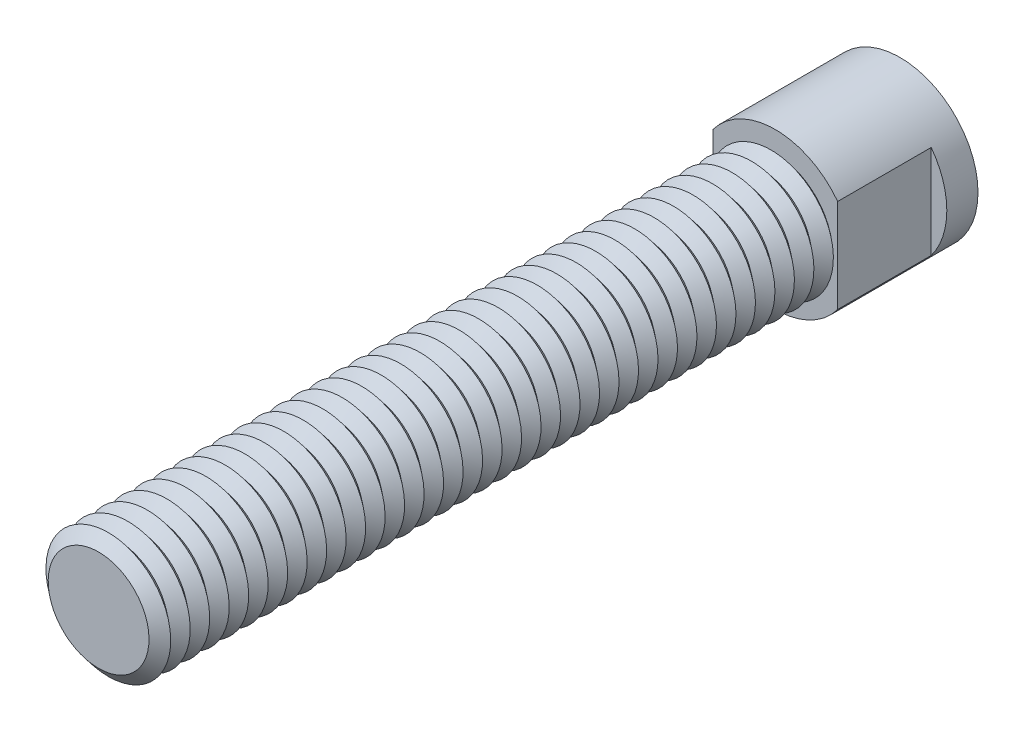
ISO-10303-21;
HEADER;
FILE_DESCRIPTION(('STEP AP214'),'2;1');
FILE_NAME('part.step','',(''),(''),'','','');
FILE_SCHEMA(('AUTOMOTIVE_DESIGN { 1 0 10303 214 1 1 1 1 }'));
ENDSEC;
DATA;
#1=APPLICATION_CONTEXT('core data for automotive mechanical design processes');
#2=APPLICATION_PROTOCOL_DEFINITION('international standard','automotive_design',2000,#1);
#3=PRODUCT_CONTEXT('',#1,'mechanical');
#4=PRODUCT('Part','Part','',(#3));
#5=PRODUCT_RELATED_PRODUCT_CATEGORY('part','',(#4));
#6=PRODUCT_DEFINITION_FORMATION('','',#4);
#7=PRODUCT_DEFINITION_CONTEXT('part definition',#1,'design');
#8=PRODUCT_DEFINITION('design','',#6,#7);
#9=PRODUCT_DEFINITION_SHAPE('','',#8);
#10=(LENGTH_UNIT() NAMED_UNIT(*) SI_UNIT(.MILLI.,.METRE.));
#11=(NAMED_UNIT(*) PLANE_ANGLE_UNIT() SI_UNIT($,.RADIAN.));
#12=(NAMED_UNIT(*) SI_UNIT($,.STERADIAN.) SOLID_ANGLE_UNIT());
#13=UNCERTAINTY_MEASURE_WITH_UNIT(LENGTH_MEASURE(1.E-05),#10,'distance_accuracy_value','');
#14=(GEOMETRIC_REPRESENTATION_CONTEXT(3) GLOBAL_UNCERTAINTY_ASSIGNED_CONTEXT((#13)) GLOBAL_UNIT_ASSIGNED_CONTEXT((#10,
#11,#12)) REPRESENTATION_CONTEXT('',''));
#15=CARTESIAN_POINT('',(0.,0.,0.));
#16=DIRECTION('',(0.,0.,1.));
#17=DIRECTION('',(1.,0.,0.));
#18=AXIS2_PLACEMENT_3D('',#15,#16,#17);
#19=CARTESIAN_POINT('',(296.5,145.,73.));
#20=DIRECTION('',(0.,0.,-1.));
#21=DIRECTION('',(-1.,0.,0.));
#22=AXIS2_PLACEMENT_3D('',#19,#20,#21);
#23=PLANE('',#22);
#24=CARTESIAN_POINT('',(296.5,145.,73.0000000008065));
#25=DIRECTION('',(0.,0.,-1.));
#26=DIRECTION('',(-1.,0.,0.));
#27=AXIS2_PLACEMENT_3D('',#24,#25,#26);
#28=CIRCLE('',#27,3.23300000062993);
#29=CARTESIAN_POINT('',(296.5,141.76699999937,73.0000000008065));
#30=VERTEX_POINT('',#29);
#31=EDGE_CURVE('E18',#30,#30,#28,.T.);
#32=ORIENTED_EDGE('',*,*,#31,.F.);
#33=EDGE_LOOP('',(#32));
#34=FACE_BOUND('',#33,.T.);
#35=ADVANCED_FACE('F15',(#34),#23,.F.);
#36=CARTESIAN_POINT('',(296.5,145.,72.3750000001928));
#37=DIRECTION('',(0.,0.,-1.));
#38=DIRECTION('',(-1.,0.,0.));
#39=AXIS2_PLACEMENT_3D('',#36,#37,#38);
#40=CONICAL_SURFACE('',#39,3.99999999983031,0.887057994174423);
#41=ORIENTED_EDGE('',*,*,#31,.T.);
#42=EDGE_LOOP('',(#41));
#43=FACE_BOUND('',#42,.T.);
#44=CARTESIAN_POINT('',(296.5,145.,72.3750000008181));
#45=DIRECTION('',(0.,0.,1.));
#46=DIRECTION('',(0.,1.,0.));
#47=AXIS2_PLACEMENT_3D('',#44,#45,#46);
#48=CIRCLE('',#47,3.99999999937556);
#49=CARTESIAN_POINT('',(296.5,141.000000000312,72.3750000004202));
#50=VERTEX_POINT('',#49);
#51=EDGE_CURVE('E34',#50,#50,#48,.F.);
#52=ORIENTED_EDGE('',*,*,#51,.F.);
#53=EDGE_LOOP('',(#52));
#54=FACE_BOUND('',#53,.T.);
#55=ADVANCED_FACE('F1327',(#43,#54),#40,.T.);
#56=CARTESIAN_POINT('',(296.5,145.,72.3750000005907));
#57=DIRECTION('',(0.,0.,1.));
#58=DIRECTION('',(1.,0.,0.));
#59=AXIS2_PLACEMENT_3D('',#56,#57,#58);
#60=CONICAL_SURFACE('',#59,3.99999999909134,0.887057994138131);
#61=ORIENTED_EDGE('',*,*,#51,.T.);
#62=EDGE_LOOP('',(#61));
#63=FACE_BOUND('',#62,.T.);
#64=CARTESIAN_POINT('',(296.5,145.,71.7500000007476));
#65=DIRECTION('',(0.,0.,-1.));
#66=DIRECTION('',(0.,1.,0.));
#67=AXIS2_PLACEMENT_3D('',#64,#65,#66);
#68=CIRCLE('',#67,3.23300000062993);
#69=CARTESIAN_POINT('',(296.5,141.766999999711,71.7500000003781));
#70=VERTEX_POINT('',#69);
#71=EDGE_CURVE('E279',#70,#70,#68,.T.);
#72=ORIENTED_EDGE('',*,*,#71,.F.);
#73=EDGE_LOOP('',(#72));
#74=FACE_BOUND('',#73,.T.);
#75=ADVANCED_FACE('F1319',(#63,#74),#60,.T.);
#76=CARTESIAN_POINT('',(296.5,145.,71.1250000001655));
#77=DIRECTION('',(0.,0.,-1.));
#78=DIRECTION('',(-1.,0.,0.));
#79=AXIS2_PLACEMENT_3D('',#76,#77,#78);
#80=CONICAL_SURFACE('',#79,3.99999999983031,0.887057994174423);
#81=ORIENTED_EDGE('',*,*,#71,.T.);
#82=EDGE_LOOP('',(#81));
#83=FACE_BOUND('',#82,.T.);
#84=CARTESIAN_POINT('',(296.5,145.,71.1250000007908));
#85=DIRECTION('',(0.,0.,1.));
#86=DIRECTION('',(0.,1.,0.));
#87=AXIS2_PLACEMENT_3D('',#84,#85,#86);
#88=CIRCLE('',#87,3.99999999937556);
#89=CARTESIAN_POINT('',(296.5,141.000000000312,71.1250000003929));
#90=VERTEX_POINT('',#89);
#91=EDGE_CURVE('E275',#90,#90,#88,.F.);
#92=ORIENTED_EDGE('',*,*,#91,.F.);
#93=EDGE_LOOP('',(#92));
#94=FACE_BOUND('',#93,.T.);
#95=ADVANCED_FACE('F276',(#83,#94),#80,.T.);
#96=CARTESIAN_POINT('',(296.5,145.,71.1250000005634));
#97=DIRECTION('',(0.,0.,1.));
#98=DIRECTION('',(1.,0.,0.));
#99=AXIS2_PLACEMENT_3D('',#96,#97,#98);
#100=CONICAL_SURFACE('',#99,3.99999999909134,0.887057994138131);
#101=ORIENTED_EDGE('',*,*,#91,.T.);
#102=EDGE_LOOP('',(#101));
#103=FACE_BOUND('',#102,.T.);
#104=CARTESIAN_POINT('',(296.5,145.,70.5000000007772));
#105=DIRECTION('',(0.,0.,-1.));
#106=DIRECTION('',(0.,1.,0.));
#107=AXIS2_PLACEMENT_3D('',#104,#105,#106);
#108=CIRCLE('',#107,3.23300000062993);
#109=CARTESIAN_POINT('',(296.5,141.766999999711,70.5000000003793));
#110=VERTEX_POINT('',#109);
#111=EDGE_CURVE('E278',#110,#110,#108,.T.);
#112=ORIENTED_EDGE('',*,*,#111,.F.);
#113=EDGE_LOOP('',(#112));
#114=FACE_BOUND('',#113,.T.);
#115=ADVANCED_FACE('F659',(#103,#114),#100,.T.);
#116=CARTESIAN_POINT('',(296.5,145.,69.8750000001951));
#117=DIRECTION('',(0.,0.,-1.));
#118=DIRECTION('',(-1.,0.,0.));
#119=AXIS2_PLACEMENT_3D('',#116,#117,#118);
#120=CONICAL_SURFACE('',#119,3.99999999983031,0.887057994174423);
#121=ORIENTED_EDGE('',*,*,#111,.T.);
#122=EDGE_LOOP('',(#121));
#123=FACE_BOUND('',#122,.T.);
#124=CARTESIAN_POINT('',(296.5,145.,69.8750000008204));
#125=DIRECTION('',(0.,0.,1.));
#126=DIRECTION('',(0.,1.,0.));
#127=AXIS2_PLACEMENT_3D('',#124,#125,#126);
#128=CIRCLE('',#127,3.99999999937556);
#129=CARTESIAN_POINT('',(296.5,141.000000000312,69.8750000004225));
#130=VERTEX_POINT('',#129);
#131=EDGE_CURVE('E282',#130,#130,#128,.F.);
#132=ORIENTED_EDGE('',*,*,#131,.F.);
#133=EDGE_LOOP('',(#132));
#134=FACE_BOUND('',#133,.T.);
#135=ADVANCED_FACE('F657',(#123,#134),#120,.T.);
#136=CARTESIAN_POINT('',(296.5,145.,69.875000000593));
#137=DIRECTION('',(0.,0.,1.));
#138=DIRECTION('',(1.,0.,0.));
#139=AXIS2_PLACEMENT_3D('',#136,#137,#138);
#140=CONICAL_SURFACE('',#139,3.99999999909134,0.887057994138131);
#141=ORIENTED_EDGE('',*,*,#131,.T.);
#142=EDGE_LOOP('',(#141));
#143=FACE_BOUND('',#142,.T.);
#144=CARTESIAN_POINT('',(296.5,145.,69.2500000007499));
#145=DIRECTION('',(0.,0.,-1.));
#146=DIRECTION('',(0.,1.,0.));
#147=AXIS2_PLACEMENT_3D('',#144,#145,#146);
#148=CIRCLE('',#147,3.23300000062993);
#149=CARTESIAN_POINT('',(296.5,141.766999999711,69.2500000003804));
#150=VERTEX_POINT('',#149);
#151=EDGE_CURVE('E643',#150,#150,#148,.T.);
#152=ORIENTED_EDGE('',*,*,#151,.F.);
#153=EDGE_LOOP('',(#152));
#154=FACE_BOUND('',#153,.T.);
#155=ADVANCED_FACE('F654',(#143,#154),#140,.T.);
#156=CARTESIAN_POINT('',(296.5,145.,68.6250000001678));
#157=DIRECTION('',(0.,0.,-1.));
#158=DIRECTION('',(-1.,0.,0.));
#159=AXIS2_PLACEMENT_3D('',#156,#157,#158);
#160=CONICAL_SURFACE('',#159,3.99999999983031,0.887057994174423);
#161=ORIENTED_EDGE('',*,*,#151,.T.);
#162=EDGE_LOOP('',(#161));
#163=FACE_BOUND('',#162,.T.);
#164=CARTESIAN_POINT('',(296.5,145.,68.6250000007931));
#165=DIRECTION('',(0.,0.,1.));
#166=DIRECTION('',(0.,1.,0.));
#167=AXIS2_PLACEMENT_3D('',#164,#165,#166);
#168=CIRCLE('',#167,3.99999999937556);
#169=CARTESIAN_POINT('',(296.5,141.000000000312,68.6250000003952));
#170=VERTEX_POINT('',#169);
#171=EDGE_CURVE('E638',#170,#170,#168,.F.);
#172=ORIENTED_EDGE('',*,*,#171,.F.);
#173=EDGE_LOOP('',(#172));
#174=FACE_BOUND('',#173,.T.);
#175=ADVANCED_FACE('F667',(#163,#174),#160,.T.);
#176=CARTESIAN_POINT('',(296.5,145.,68.6250000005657));
#177=DIRECTION('',(0.,0.,1.));
#178=DIRECTION('',(1.,0.,0.));
#179=AXIS2_PLACEMENT_3D('',#176,#177,#178);
#180=CONICAL_SURFACE('',#179,3.99999999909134,0.887057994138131);
#181=ORIENTED_EDGE('',*,*,#171,.T.);
#182=EDGE_LOOP('',(#181));
#183=FACE_BOUND('',#182,.T.);
#184=CARTESIAN_POINT('',(296.5,145.,68.0000000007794));
#185=DIRECTION('',(0.,0.,-1.));
#186=DIRECTION('',(0.,1.,0.));
#187=AXIS2_PLACEMENT_3D('',#184,#185,#186);
#188=CIRCLE('',#187,3.23300000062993);
#189=CARTESIAN_POINT('',(296.5,141.766999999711,68.0000000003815));
#190=VERTEX_POINT('',#189);
#191=EDGE_CURVE('E633',#190,#190,#188,.T.);
#192=ORIENTED_EDGE('',*,*,#191,.F.);
#193=EDGE_LOOP('',(#192));
#194=FACE_BOUND('',#193,.T.);
#195=ADVANCED_FACE('F948',(#183,#194),#180,.T.);
#196=CARTESIAN_POINT('',(296.5,145.,67.3750000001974));
#197=DIRECTION('',(0.,0.,-1.));
#198=DIRECTION('',(-1.,0.,0.));
#199=AXIS2_PLACEMENT_3D('',#196,#197,#198);
#200=CONICAL_SURFACE('',#199,3.99999999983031,0.887057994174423);
#201=ORIENTED_EDGE('',*,*,#191,.T.);
#202=EDGE_LOOP('',(#201));
#203=FACE_BOUND('',#202,.T.);
#204=CARTESIAN_POINT('',(296.5,145.,67.3750000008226));
#205=DIRECTION('',(0.,0.,1.));
#206=DIRECTION('',(0.,1.,0.));
#207=AXIS2_PLACEMENT_3D('',#204,#205,#206);
#208=CIRCLE('',#207,3.99999999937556);
#209=CARTESIAN_POINT('',(296.5,141.000000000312,67.3750000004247));
#210=VERTEX_POINT('',#209);
#211=EDGE_CURVE('E628',#210,#210,#208,.F.);
#212=ORIENTED_EDGE('',*,*,#211,.F.);
#213=EDGE_LOOP('',(#212));
#214=FACE_BOUND('',#213,.T.);
#215=ADVANCED_FACE('F944',(#203,#214),#200,.T.);
#216=CARTESIAN_POINT('',(296.5,145.,67.3750000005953));
#217=DIRECTION('',(0.,0.,1.));
#218=DIRECTION('',(1.,0.,0.));
#219=AXIS2_PLACEMENT_3D('',#216,#217,#218);
#220=CONICAL_SURFACE('',#219,3.99999999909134,0.887057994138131);
#221=ORIENTED_EDGE('',*,*,#211,.T.);
#222=EDGE_LOOP('',(#221));
#223=FACE_BOUND('',#222,.T.);
#224=CARTESIAN_POINT('',(296.5,145.,66.7500000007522));
#225=DIRECTION('',(0.,0.,-1.));
#226=DIRECTION('',(0.,1.,0.));
#227=AXIS2_PLACEMENT_3D('',#224,#225,#226);
#228=CIRCLE('',#227,3.23300000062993);
#229=CARTESIAN_POINT('',(296.5,141.766999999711,66.7500000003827));
#230=VERTEX_POINT('',#229);
#231=EDGE_CURVE('E623',#230,#230,#228,.T.);
#232=ORIENTED_EDGE('',*,*,#231,.F.);
#233=EDGE_LOOP('',(#232));
#234=FACE_BOUND('',#233,.T.);
#235=ADVANCED_FACE('F940',(#223,#234),#220,.T.);
#236=CARTESIAN_POINT('',(296.5,145.,66.1250000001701));
#237=DIRECTION('',(0.,0.,-1.));
#238=DIRECTION('',(-1.,0.,0.));
#239=AXIS2_PLACEMENT_3D('',#236,#237,#238);
#240=CONICAL_SURFACE('',#239,3.99999999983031,0.887057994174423);
#241=ORIENTED_EDGE('',*,*,#231,.T.);
#242=EDGE_LOOP('',(#241));
#243=FACE_BOUND('',#242,.T.);
#244=CARTESIAN_POINT('',(296.5,145.,66.1250000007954));
#245=DIRECTION('',(0.,0.,1.));
#246=DIRECTION('',(0.,1.,0.));
#247=AXIS2_PLACEMENT_3D('',#244,#245,#246);
#248=CIRCLE('',#247,3.99999999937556);
#249=CARTESIAN_POINT('',(296.5,141.000000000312,66.1250000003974));
#250=VERTEX_POINT('',#249);
#251=EDGE_CURVE('E618',#250,#250,#248,.F.);
#252=ORIENTED_EDGE('',*,*,#251,.F.);
#253=EDGE_LOOP('',(#252));
#254=FACE_BOUND('',#253,.T.);
#255=ADVANCED_FACE('F936',(#243,#254),#240,.T.);
#256=CARTESIAN_POINT('',(296.5,145.,66.125000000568));
#257=DIRECTION('',(0.,0.,1.));
#258=DIRECTION('',(1.,0.,0.));
#259=AXIS2_PLACEMENT_3D('',#256,#257,#258);
#260=CONICAL_SURFACE('',#259,3.99999999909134,0.887057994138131);
#261=ORIENTED_EDGE('',*,*,#251,.T.);
#262=EDGE_LOOP('',(#261));
#263=FACE_BOUND('',#262,.T.);
#264=CARTESIAN_POINT('',(296.5,145.,65.5000000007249));
#265=DIRECTION('',(0.,0.,-1.));
#266=DIRECTION('',(0.,1.,0.));
#267=AXIS2_PLACEMENT_3D('',#264,#265,#266);
#268=CIRCLE('',#267,3.23300000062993);
#269=CARTESIAN_POINT('',(296.5,141.766999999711,65.5000000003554));
#270=VERTEX_POINT('',#269);
#271=EDGE_CURVE('E613',#270,#270,#268,.T.);
#272=ORIENTED_EDGE('',*,*,#271,.F.);
#273=EDGE_LOOP('',(#272));
#274=FACE_BOUND('',#273,.T.);
#275=ADVANCED_FACE('F932',(#263,#274),#260,.T.);
#276=CARTESIAN_POINT('',(296.5,145.,64.8750000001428));
#277=DIRECTION('',(0.,0.,-1.));
#278=DIRECTION('',(-1.,0.,0.));
#279=AXIS2_PLACEMENT_3D('',#276,#277,#278);
#280=CONICAL_SURFACE('',#279,3.99999999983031,0.887057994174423);
#281=ORIENTED_EDGE('',*,*,#271,.T.);
#282=EDGE_LOOP('',(#281));
#283=FACE_BOUND('',#282,.T.);
#284=CARTESIAN_POINT('',(296.5,145.,64.8750000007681));
#285=DIRECTION('',(0.,0.,1.));
#286=DIRECTION('',(0.,1.,0.));
#287=AXIS2_PLACEMENT_3D('',#284,#285,#286);
#288=CIRCLE('',#287,3.99999999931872);
#289=CARTESIAN_POINT('',(296.5,141.00000000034,64.8750000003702));
#290=VERTEX_POINT('',#289);
#291=EDGE_CURVE('E608',#290,#290,#288,.F.);
#292=ORIENTED_EDGE('',*,*,#291,.F.);
#293=EDGE_LOOP('',(#292));
#294=FACE_BOUND('',#293,.T.);
#295=ADVANCED_FACE('F928',(#283,#294),#280,.T.);
#296=CARTESIAN_POINT('',(296.5,145.,64.8750000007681));
#297=DIRECTION('',(0.,0.,1.));
#298=DIRECTION('',(1.,0.,0.));
#299=AXIS2_PLACEMENT_3D('',#296,#297,#298);
#300=CONICAL_SURFACE('',#299,3.99999999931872,0.887057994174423);
#301=ORIENTED_EDGE('',*,*,#291,.T.);
#302=EDGE_LOOP('',(#301));
#303=FACE_BOUND('',#302,.T.);
#304=CARTESIAN_POINT('',(296.5,145.,64.2500000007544));
#305=DIRECTION('',(0.,0.,-1.));
#306=DIRECTION('',(0.,1.,0.));
#307=AXIS2_PLACEMENT_3D('',#304,#305,#306);
#308=CIRCLE('',#307,3.23300000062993);
#309=CARTESIAN_POINT('',(296.5,141.766999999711,64.2500000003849));
#310=VERTEX_POINT('',#309);
#311=EDGE_CURVE('E603',#310,#310,#308,.T.);
#312=ORIENTED_EDGE('',*,*,#311,.F.);
#313=EDGE_LOOP('',(#312));
#314=FACE_BOUND('',#313,.T.);
#315=ADVANCED_FACE('F924',(#303,#314),#300,.T.);
#316=CARTESIAN_POINT('',(296.5,145.,63.6250000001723));
#317=DIRECTION('',(0.,0.,-1.));
#318=DIRECTION('',(-1.,0.,0.));
#319=AXIS2_PLACEMENT_3D('',#316,#317,#318);
#320=CONICAL_SURFACE('',#319,3.99999999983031,0.887057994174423);
#321=ORIENTED_EDGE('',*,*,#311,.T.);
#322=EDGE_LOOP('',(#321));
#323=FACE_BOUND('',#322,.T.);
#324=CARTESIAN_POINT('',(296.5,145.,63.6250000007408));
#325=DIRECTION('',(0.,0.,1.));
#326=DIRECTION('',(0.,1.,0.));
#327=AXIS2_PLACEMENT_3D('',#324,#325,#326);
#328=CIRCLE('',#327,3.99999999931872);
#329=CARTESIAN_POINT('',(296.5,141.00000000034,63.6250000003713));
#330=VERTEX_POINT('',#329);
#331=EDGE_CURVE('E598',#330,#330,#328,.F.);
#332=ORIENTED_EDGE('',*,*,#331,.F.);
#333=EDGE_LOOP('',(#332));
#334=FACE_BOUND('',#333,.T.);
#335=ADVANCED_FACE('F920',(#323,#334),#320,.T.);
#336=CARTESIAN_POINT('',(296.5,145.,63.6250000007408));
#337=DIRECTION('',(0.,0.,1.));
#338=DIRECTION('',(1.,0.,0.));
#339=AXIS2_PLACEMENT_3D('',#336,#337,#338);
#340=CONICAL_SURFACE('',#339,3.99999999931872,0.887057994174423);
#341=ORIENTED_EDGE('',*,*,#331,.T.);
#342=EDGE_LOOP('',(#341));
#343=FACE_BOUND('',#342,.T.);
#344=CARTESIAN_POINT('',(296.5,145.,63.0000000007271));
#345=DIRECTION('',(0.,0.,-1.));
#346=DIRECTION('',(0.,1.,0.));
#347=AXIS2_PLACEMENT_3D('',#344,#345,#346);
#348=CIRCLE('',#347,3.23300000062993);
#349=CARTESIAN_POINT('',(296.5,141.766999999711,63.0000000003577));
#350=VERTEX_POINT('',#349);
#351=EDGE_CURVE('E593',#350,#350,#348,.T.);
#352=ORIENTED_EDGE('',*,*,#351,.F.);
#353=EDGE_LOOP('',(#352));
#354=FACE_BOUND('',#353,.T.);
#355=ADVANCED_FACE('F916',(#343,#354),#340,.T.);
#356=CARTESIAN_POINT('',(296.5,145.,62.3750000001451));
#357=DIRECTION('',(0.,0.,-1.));
#358=DIRECTION('',(-1.,0.,0.));
#359=AXIS2_PLACEMENT_3D('',#356,#357,#358);
#360=CONICAL_SURFACE('',#359,3.99999999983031,0.887057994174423);
#361=ORIENTED_EDGE('',*,*,#351,.T.);
#362=EDGE_LOOP('',(#361));
#363=FACE_BOUND('',#362,.T.);
#364=CARTESIAN_POINT('',(296.5,145.,62.3750000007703));
#365=DIRECTION('',(0.,0.,1.));
#366=DIRECTION('',(0.,1.,0.));
#367=AXIS2_PLACEMENT_3D('',#364,#365,#366);
#368=CIRCLE('',#367,3.99999999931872);
#369=CARTESIAN_POINT('',(296.5,141.00000000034,62.3750000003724));
#370=VERTEX_POINT('',#369);
#371=EDGE_CURVE('E588',#370,#370,#368,.F.);
#372=ORIENTED_EDGE('',*,*,#371,.F.);
#373=EDGE_LOOP('',(#372));
#374=FACE_BOUND('',#373,.T.);
#375=ADVANCED_FACE('F912',(#363,#374),#360,.T.);
#376=CARTESIAN_POINT('',(296.5,145.,62.3750000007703));
#377=DIRECTION('',(0.,0.,1.));
#378=DIRECTION('',(1.,0.,0.));
#379=AXIS2_PLACEMENT_3D('',#376,#377,#378);
#380=CONICAL_SURFACE('',#379,3.99999999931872,0.887057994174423);
#381=ORIENTED_EDGE('',*,*,#371,.T.);
#382=EDGE_LOOP('',(#381));
#383=FACE_BOUND('',#382,.T.);
#384=CARTESIAN_POINT('',(296.5,145.,61.7500000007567));
#385=DIRECTION('',(0.,0.,-1.));
#386=DIRECTION('',(0.,1.,0.));
#387=AXIS2_PLACEMENT_3D('',#384,#385,#386);
#388=CIRCLE('',#387,3.23300000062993);
#389=CARTESIAN_POINT('',(296.5,141.766999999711,61.7500000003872));
#390=VERTEX_POINT('',#389);
#391=EDGE_CURVE('E583',#390,#390,#388,.T.);
#392=ORIENTED_EDGE('',*,*,#391,.F.);
#393=EDGE_LOOP('',(#392));
#394=FACE_BOUND('',#393,.T.);
#395=ADVANCED_FACE('F908',(#383,#394),#380,.T.);
#396=CARTESIAN_POINT('',(296.5,145.,61.1250000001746));
#397=DIRECTION('',(0.,0.,-1.));
#398=DIRECTION('',(-1.,0.,0.));
#399=AXIS2_PLACEMENT_3D('',#396,#397,#398);
#400=CONICAL_SURFACE('',#399,3.99999999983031,0.887057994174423);
#401=ORIENTED_EDGE('',*,*,#391,.T.);
#402=EDGE_LOOP('',(#401));
#403=FACE_BOUND('',#402,.T.);
#404=CARTESIAN_POINT('',(296.5,145.,61.1250000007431));
#405=DIRECTION('',(0.,0.,1.));
#406=DIRECTION('',(0.,1.,0.));
#407=AXIS2_PLACEMENT_3D('',#404,#405,#406);
#408=CIRCLE('',#407,3.99999999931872);
#409=CARTESIAN_POINT('',(296.5,141.00000000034,61.1250000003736));
#410=VERTEX_POINT('',#409);
#411=EDGE_CURVE('E578',#410,#410,#408,.F.);
#412=ORIENTED_EDGE('',*,*,#411,.F.);
#413=EDGE_LOOP('',(#412));
#414=FACE_BOUND('',#413,.T.);
#415=ADVANCED_FACE('F904',(#403,#414),#400,.T.);
#416=CARTESIAN_POINT('',(296.5,145.,61.1250000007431));
#417=DIRECTION('',(0.,0.,1.));
#418=DIRECTION('',(1.,0.,0.));
#419=AXIS2_PLACEMENT_3D('',#416,#417,#418);
#420=CONICAL_SURFACE('',#419,3.99999999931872,0.887057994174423);
#421=ORIENTED_EDGE('',*,*,#411,.T.);
#422=EDGE_LOOP('',(#421));
#423=FACE_BOUND('',#422,.T.);
#424=CARTESIAN_POINT('',(296.5,145.,60.5000000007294));
#425=DIRECTION('',(0.,0.,-1.));
#426=DIRECTION('',(0.,1.,0.));
#427=AXIS2_PLACEMENT_3D('',#424,#425,#426);
#428=CIRCLE('',#427,3.23300000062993);
#429=CARTESIAN_POINT('',(296.5,141.766999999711,60.5000000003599));
#430=VERTEX_POINT('',#429);
#431=EDGE_CURVE('E573',#430,#430,#428,.T.);
#432=ORIENTED_EDGE('',*,*,#431,.F.);
#433=EDGE_LOOP('',(#432));
#434=FACE_BOUND('',#433,.T.);
#435=ADVANCED_FACE('F900',(#423,#434),#420,.T.);
#436=CARTESIAN_POINT('',(296.5,145.,59.8749999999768));
#437=DIRECTION('',(0.,0.,-1.));
#438=DIRECTION('',(-1.,0.,0.));
#439=AXIS2_PLACEMENT_3D('',#436,#437,#438);
#440=CONICAL_SURFACE('',#439,3.99999999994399,0.887057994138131);
#441=ORIENTED_EDGE('',*,*,#431,.T.);
#442=EDGE_LOOP('',(#441));
#443=FACE_BOUND('',#442,.T.);
#444=CARTESIAN_POINT('',(296.5,145.,59.8750000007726));
#445=DIRECTION('',(0.,0.,1.));
#446=DIRECTION('',(0.,1.,0.));
#447=AXIS2_PLACEMENT_3D('',#444,#445,#446);
#448=CIRCLE('',#447,3.99999999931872);
#449=CARTESIAN_POINT('',(296.5,141.000000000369,59.8750000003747));
#450=VERTEX_POINT('',#449);
#451=EDGE_CURVE('E568',#450,#450,#448,.F.);
#452=ORIENTED_EDGE('',*,*,#451,.F.);
#453=EDGE_LOOP('',(#452));
#454=FACE_BOUND('',#453,.T.);
#455=ADVANCED_FACE('F896',(#443,#454),#440,.T.);
#456=CARTESIAN_POINT('',(296.5,145.,59.8750000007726));
#457=DIRECTION('',(0.,0.,1.));
#458=DIRECTION('',(1.,0.,0.));
#459=AXIS2_PLACEMENT_3D('',#456,#457,#458);
#460=CONICAL_SURFACE('',#459,3.99999999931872,0.887057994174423);
#461=ORIENTED_EDGE('',*,*,#451,.T.);
#462=EDGE_LOOP('',(#461));
#463=FACE_BOUND('',#462,.T.);
#464=CARTESIAN_POINT('',(296.5,145.,59.250000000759));
#465=DIRECTION('',(0.,0.,-1.));
#466=DIRECTION('',(0.,1.,0.));
#467=AXIS2_PLACEMENT_3D('',#464,#465,#466);
#468=CIRCLE('',#467,3.23300000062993);
#469=CARTESIAN_POINT('',(296.5,141.766999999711,59.2500000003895));
#470=VERTEX_POINT('',#469);
#471=EDGE_CURVE('E563',#470,#470,#468,.T.);
#472=ORIENTED_EDGE('',*,*,#471,.F.);
#473=EDGE_LOOP('',(#472));
#474=FACE_BOUND('',#473,.T.);
#475=ADVANCED_FACE('F892',(#463,#474),#460,.T.);
#476=CARTESIAN_POINT('',(296.5,145.,58.6250000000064));
#477=DIRECTION('',(0.,0.,-1.));
#478=DIRECTION('',(-1.,0.,0.));
#479=AXIS2_PLACEMENT_3D('',#476,#477,#478);
#480=CONICAL_SURFACE('',#479,3.99999999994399,0.887057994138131);
#481=ORIENTED_EDGE('',*,*,#471,.T.);
#482=EDGE_LOOP('',(#481));
#483=FACE_BOUND('',#482,.T.);
#484=CARTESIAN_POINT('',(296.5,145.,58.6250000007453));
#485=DIRECTION('',(0.,0.,1.));
#486=DIRECTION('',(0.,1.,0.));
#487=AXIS2_PLACEMENT_3D('',#484,#485,#486);
#488=CIRCLE('',#487,3.99999999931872);
#489=CARTESIAN_POINT('',(296.5,141.000000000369,58.6250000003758));
#490=VERTEX_POINT('',#489);
#491=EDGE_CURVE('E558',#490,#490,#488,.F.);
#492=ORIENTED_EDGE('',*,*,#491,.F.);
#493=EDGE_LOOP('',(#492));
#494=FACE_BOUND('',#493,.T.);
#495=ADVANCED_FACE('F888',(#483,#494),#480,.T.);
#496=CARTESIAN_POINT('',(296.5,145.,58.6250000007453));
#497=DIRECTION('',(0.,0.,1.));
#498=DIRECTION('',(1.,0.,0.));
#499=AXIS2_PLACEMENT_3D('',#496,#497,#498);
#500=CONICAL_SURFACE('',#499,3.99999999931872,0.887057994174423);
#501=ORIENTED_EDGE('',*,*,#491,.T.);
#502=EDGE_LOOP('',(#501));
#503=FACE_BOUND('',#502,.T.);
#504=CARTESIAN_POINT('',(296.5,145.,58.0000000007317));
#505=DIRECTION('',(0.,0.,-1.));
#506=DIRECTION('',(0.,1.,0.));
#507=AXIS2_PLACEMENT_3D('',#504,#505,#506);
#508=CIRCLE('',#507,3.23300000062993);
#509=CARTESIAN_POINT('',(296.5,141.766999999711,58.0000000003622));
#510=VERTEX_POINT('',#509);
#511=EDGE_CURVE('E553',#510,#510,#508,.T.);
#512=ORIENTED_EDGE('',*,*,#511,.F.);
#513=EDGE_LOOP('',(#512));
#514=FACE_BOUND('',#513,.T.);
#515=ADVANCED_FACE('F884',(#503,#514),#500,.T.);
#516=CARTESIAN_POINT('',(296.5,145.,57.3749999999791));
#517=DIRECTION('',(0.,0.,-1.));
#518=DIRECTION('',(-1.,0.,0.));
#519=AXIS2_PLACEMENT_3D('',#516,#517,#518);
#520=CONICAL_SURFACE('',#519,3.99999999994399,0.887057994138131);
#521=ORIENTED_EDGE('',*,*,#511,.T.);
#522=EDGE_LOOP('',(#521));
#523=FACE_BOUND('',#522,.T.);
#524=CARTESIAN_POINT('',(296.5,145.,57.3750000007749));
#525=DIRECTION('',(0.,0.,1.));
#526=DIRECTION('',(0.,1.,0.));
#527=AXIS2_PLACEMENT_3D('',#524,#525,#526);
#528=CIRCLE('',#527,3.99999999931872);
#529=CARTESIAN_POINT('',(296.5,141.000000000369,57.375000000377));
#530=VERTEX_POINT('',#529);
#531=EDGE_CURVE('E548',#530,#530,#528,.F.);
#532=ORIENTED_EDGE('',*,*,#531,.F.);
#533=EDGE_LOOP('',(#532));
#534=FACE_BOUND('',#533,.T.);
#535=ADVANCED_FACE('F880',(#523,#534),#520,.T.);
#536=CARTESIAN_POINT('',(296.5,145.,57.3750000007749));
#537=DIRECTION('',(0.,0.,1.));
#538=DIRECTION('',(1.,0.,0.));
#539=AXIS2_PLACEMENT_3D('',#536,#537,#538);
#540=CONICAL_SURFACE('',#539,3.99999999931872,0.887057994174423);
#541=ORIENTED_EDGE('',*,*,#531,.T.);
#542=EDGE_LOOP('',(#541));
#543=FACE_BOUND('',#542,.T.);
#544=CARTESIAN_POINT('',(296.5,145.,56.7500000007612));
#545=DIRECTION('',(0.,0.,-1.));
#546=DIRECTION('',(0.,1.,0.));
#547=AXIS2_PLACEMENT_3D('',#544,#545,#546);
#548=CIRCLE('',#547,3.23300000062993);
#549=CARTESIAN_POINT('',(296.5,141.766999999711,56.7500000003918));
#550=VERTEX_POINT('',#549);
#551=EDGE_CURVE('E543',#550,#550,#548,.T.);
#552=ORIENTED_EDGE('',*,*,#551,.F.);
#553=EDGE_LOOP('',(#552));
#554=FACE_BOUND('',#553,.T.);
#555=ADVANCED_FACE('F876',(#543,#554),#540,.T.);
#556=CARTESIAN_POINT('',(296.5,145.,56.1250000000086));
#557=DIRECTION('',(0.,0.,-1.));
#558=DIRECTION('',(-1.,0.,0.));
#559=AXIS2_PLACEMENT_3D('',#556,#557,#558);
#560=CONICAL_SURFACE('',#559,3.99999999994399,0.887057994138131);
#561=ORIENTED_EDGE('',*,*,#551,.T.);
#562=EDGE_LOOP('',(#561));
#563=FACE_BOUND('',#562,.T.);
#564=CARTESIAN_POINT('',(296.5,145.,56.1250000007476));
#565=DIRECTION('',(0.,0.,1.));
#566=DIRECTION('',(0.,1.,0.));
#567=AXIS2_PLACEMENT_3D('',#564,#565,#566);
#568=CIRCLE('',#567,3.99999999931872);
#569=CARTESIAN_POINT('',(296.5,141.000000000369,56.1250000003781));
#570=VERTEX_POINT('',#569);
#571=EDGE_CURVE('E538',#570,#570,#568,.F.);
#572=ORIENTED_EDGE('',*,*,#571,.F.);
#573=EDGE_LOOP('',(#572));
#574=FACE_BOUND('',#573,.T.);
#575=ADVANCED_FACE('F872',(#563,#574),#560,.T.);
#576=CARTESIAN_POINT('',(296.5,145.,56.1250000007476));
#577=DIRECTION('',(0.,0.,1.));
#578=DIRECTION('',(1.,0.,0.));
#579=AXIS2_PLACEMENT_3D('',#576,#577,#578);
#580=CONICAL_SURFACE('',#579,3.99999999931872,0.887057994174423);
#581=ORIENTED_EDGE('',*,*,#571,.T.);
#582=EDGE_LOOP('',(#581));
#583=FACE_BOUND('',#582,.T.);
#584=CARTESIAN_POINT('',(296.5,145.,55.500000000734));
#585=DIRECTION('',(0.,0.,-1.));
#586=DIRECTION('',(0.,1.,0.));
#587=AXIS2_PLACEMENT_3D('',#584,#585,#586);
#588=CIRCLE('',#587,3.23300000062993);
#589=CARTESIAN_POINT('',(296.5,141.766999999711,55.5000000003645));
#590=VERTEX_POINT('',#589);
#591=EDGE_CURVE('E533',#590,#590,#588,.T.);
#592=ORIENTED_EDGE('',*,*,#591,.F.);
#593=EDGE_LOOP('',(#592));
#594=FACE_BOUND('',#593,.T.);
#595=ADVANCED_FACE('F868',(#583,#594),#580,.T.);
#596=CARTESIAN_POINT('',(296.5,145.,54.8749999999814));
#597=DIRECTION('',(0.,0.,-1.));
#598=DIRECTION('',(-1.,0.,0.));
#599=AXIS2_PLACEMENT_3D('',#596,#597,#598);
#600=CONICAL_SURFACE('',#599,3.99999999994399,0.887057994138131);
#601=ORIENTED_EDGE('',*,*,#591,.T.);
#602=EDGE_LOOP('',(#601));
#603=FACE_BOUND('',#602,.T.);
#604=CARTESIAN_POINT('',(296.5,145.,54.8750000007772));
#605=DIRECTION('',(0.,0.,1.));
#606=DIRECTION('',(0.,1.,0.));
#607=AXIS2_PLACEMENT_3D('',#604,#605,#606);
#608=CIRCLE('',#607,3.99999999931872);
#609=CARTESIAN_POINT('',(296.5,141.000000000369,54.8750000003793));
#610=VERTEX_POINT('',#609);
#611=EDGE_CURVE('E528',#610,#610,#608,.F.);
#612=ORIENTED_EDGE('',*,*,#611,.F.);
#613=EDGE_LOOP('',(#612));
#614=FACE_BOUND('',#613,.T.);
#615=ADVANCED_FACE('F864',(#603,#614),#600,.T.);
#616=CARTESIAN_POINT('',(296.5,145.,54.8750000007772));
#617=DIRECTION('',(0.,0.,1.));
#618=DIRECTION('',(1.,0.,0.));
#619=AXIS2_PLACEMENT_3D('',#616,#617,#618);
#620=CONICAL_SURFACE('',#619,3.99999999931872,0.887057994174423);
#621=ORIENTED_EDGE('',*,*,#611,.T.);
#622=EDGE_LOOP('',(#621));
#623=FACE_BOUND('',#622,.T.);
#624=CARTESIAN_POINT('',(296.5,145.,54.2500000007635));
#625=DIRECTION('',(0.,0.,-1.));
#626=DIRECTION('',(0.,1.,0.));
#627=AXIS2_PLACEMENT_3D('',#624,#625,#626);
#628=CIRCLE('',#627,3.23300000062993);
#629=CARTESIAN_POINT('',(296.5,141.766999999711,54.250000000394));
#630=VERTEX_POINT('',#629);
#631=EDGE_CURVE('E523',#630,#630,#628,.T.);
#632=ORIENTED_EDGE('',*,*,#631,.F.);
#633=EDGE_LOOP('',(#632));
#634=FACE_BOUND('',#633,.T.);
#635=ADVANCED_FACE('F860',(#623,#634),#620,.T.);
#636=CARTESIAN_POINT('',(296.5,145.,53.6250000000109));
#637=DIRECTION('',(0.,0.,-1.));
#638=DIRECTION('',(-1.,0.,0.));
#639=AXIS2_PLACEMENT_3D('',#636,#637,#638);
#640=CONICAL_SURFACE('',#639,3.99999999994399,0.887057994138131);
#641=ORIENTED_EDGE('',*,*,#631,.T.);
#642=EDGE_LOOP('',(#641));
#643=FACE_BOUND('',#642,.T.);
#644=CARTESIAN_POINT('',(296.5,145.,53.6250000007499));
#645=DIRECTION('',(0.,0.,1.));
#646=DIRECTION('',(0.,1.,0.));
#647=AXIS2_PLACEMENT_3D('',#644,#645,#646);
#648=CIRCLE('',#647,3.99999999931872);
#649=CARTESIAN_POINT('',(296.5,141.000000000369,53.6250000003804));
#650=VERTEX_POINT('',#649);
#651=EDGE_CURVE('E518',#650,#650,#648,.F.);
#652=ORIENTED_EDGE('',*,*,#651,.F.);
#653=EDGE_LOOP('',(#652));
#654=FACE_BOUND('',#653,.T.);
#655=ADVANCED_FACE('F856',(#643,#654),#640,.T.);
#656=CARTESIAN_POINT('',(296.5,145.,53.6250000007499));
#657=DIRECTION('',(0.,0.,1.));
#658=DIRECTION('',(1.,0.,0.));
#659=AXIS2_PLACEMENT_3D('',#656,#657,#658);
#660=CONICAL_SURFACE('',#659,3.99999999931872,0.887057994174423);
#661=ORIENTED_EDGE('',*,*,#651,.T.);
#662=EDGE_LOOP('',(#661));
#663=FACE_BOUND('',#662,.T.);
#664=CARTESIAN_POINT('',(296.5,145.,53.0000000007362));
#665=DIRECTION('',(0.,0.,-1.));
#666=DIRECTION('',(0.,1.,0.));
#667=AXIS2_PLACEMENT_3D('',#664,#665,#666);
#668=CIRCLE('',#667,3.23300000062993);
#669=CARTESIAN_POINT('',(296.5,141.766999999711,53.0000000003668));
#670=VERTEX_POINT('',#669);
#671=EDGE_CURVE('E513',#670,#670,#668,.T.);
#672=ORIENTED_EDGE('',*,*,#671,.F.);
#673=EDGE_LOOP('',(#672));
#674=FACE_BOUND('',#673,.T.);
#675=ADVANCED_FACE('F852',(#663,#674),#660,.T.);
#676=CARTESIAN_POINT('',(296.5,145.,52.3749999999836));
#677=DIRECTION('',(0.,0.,-1.));
#678=DIRECTION('',(-1.,0.,0.));
#679=AXIS2_PLACEMENT_3D('',#676,#677,#678);
#680=CONICAL_SURFACE('',#679,3.99999999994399,0.887057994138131);
#681=ORIENTED_EDGE('',*,*,#671,.T.);
#682=EDGE_LOOP('',(#681));
#683=FACE_BOUND('',#682,.T.);
#684=CARTESIAN_POINT('',(296.5,145.,52.3750000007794));
#685=DIRECTION('',(0.,0.,1.));
#686=DIRECTION('',(0.,1.,0.));
#687=AXIS2_PLACEMENT_3D('',#684,#685,#686);
#688=CIRCLE('',#687,3.99999999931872);
#689=CARTESIAN_POINT('',(296.5,141.000000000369,52.3750000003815));
#690=VERTEX_POINT('',#689);
#691=EDGE_CURVE('E508',#690,#690,#688,.F.);
#692=ORIENTED_EDGE('',*,*,#691,.F.);
#693=EDGE_LOOP('',(#692));
#694=FACE_BOUND('',#693,.T.);
#695=ADVANCED_FACE('F848',(#683,#694),#680,.T.);
#696=CARTESIAN_POINT('',(296.5,145.,52.3750000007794));
#697=DIRECTION('',(0.,0.,1.));
#698=DIRECTION('',(1.,0.,0.));
#699=AXIS2_PLACEMENT_3D('',#696,#697,#698);
#700=CONICAL_SURFACE('',#699,3.99999999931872,0.887057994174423);
#701=ORIENTED_EDGE('',*,*,#691,.T.);
#702=EDGE_LOOP('',(#701));
#703=FACE_BOUND('',#702,.T.);
#704=CARTESIAN_POINT('',(296.5,145.,51.7500000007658));
#705=DIRECTION('',(0.,0.,-1.));
#706=DIRECTION('',(0.,1.,0.));
#707=AXIS2_PLACEMENT_3D('',#704,#705,#706);
#708=CIRCLE('',#707,3.23300000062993);
#709=CARTESIAN_POINT('',(296.5,141.766999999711,51.7500000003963));
#710=VERTEX_POINT('',#709);
#711=EDGE_CURVE('E503',#710,#710,#708,.T.);
#712=ORIENTED_EDGE('',*,*,#711,.F.);
#713=EDGE_LOOP('',(#712));
#714=FACE_BOUND('',#713,.T.);
#715=ADVANCED_FACE('F844',(#703,#714),#700,.T.);
#716=CARTESIAN_POINT('',(296.5,145.,51.1250000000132));
#717=DIRECTION('',(0.,0.,-1.));
#718=DIRECTION('',(-1.,0.,0.));
#719=AXIS2_PLACEMENT_3D('',#716,#717,#718);
#720=CONICAL_SURFACE('',#719,3.99999999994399,0.887057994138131);
#721=ORIENTED_EDGE('',*,*,#711,.T.);
#722=EDGE_LOOP('',(#721));
#723=FACE_BOUND('',#722,.T.);
#724=CARTESIAN_POINT('',(296.5,145.,51.1250000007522));
#725=DIRECTION('',(0.,0.,1.));
#726=DIRECTION('',(0.,1.,0.));
#727=AXIS2_PLACEMENT_3D('',#724,#725,#726);
#728=CIRCLE('',#727,3.99999999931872);
#729=CARTESIAN_POINT('',(296.5,141.000000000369,51.1250000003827));
#730=VERTEX_POINT('',#729);
#731=EDGE_CURVE('E498',#730,#730,#728,.F.);
#732=ORIENTED_EDGE('',*,*,#731,.F.);
#733=EDGE_LOOP('',(#732));
#734=FACE_BOUND('',#733,.T.);
#735=ADVANCED_FACE('F840',(#723,#734),#720,.T.);
#736=CARTESIAN_POINT('',(296.5,145.,51.1250000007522));
#737=DIRECTION('',(0.,0.,1.));
#738=DIRECTION('',(1.,0.,0.));
#739=AXIS2_PLACEMENT_3D('',#736,#737,#738);
#740=CONICAL_SURFACE('',#739,3.99999999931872,0.887057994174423);
#741=ORIENTED_EDGE('',*,*,#731,.T.);
#742=EDGE_LOOP('',(#741));
#743=FACE_BOUND('',#742,.T.);
#744=CARTESIAN_POINT('',(296.5,145.,50.5000000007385));
#745=DIRECTION('',(0.,0.,-1.));
#746=DIRECTION('',(0.,1.,0.));
#747=AXIS2_PLACEMENT_3D('',#744,#745,#746);
#748=CIRCLE('',#747,3.23300000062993);
#749=CARTESIAN_POINT('',(296.5,141.766999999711,50.500000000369));
#750=VERTEX_POINT('',#749);
#751=EDGE_CURVE('E493',#750,#750,#748,.T.);
#752=ORIENTED_EDGE('',*,*,#751,.F.);
#753=EDGE_LOOP('',(#752));
#754=FACE_BOUND('',#753,.T.);
#755=ADVANCED_FACE('F836',(#743,#754),#740,.T.);
#756=CARTESIAN_POINT('',(296.5,145.,49.8749999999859));
#757=DIRECTION('',(0.,0.,-1.));
#758=DIRECTION('',(-1.,0.,0.));
#759=AXIS2_PLACEMENT_3D('',#756,#757,#758);
#760=CONICAL_SURFACE('',#759,3.99999999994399,0.887057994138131);
#761=ORIENTED_EDGE('',*,*,#751,.T.);
#762=EDGE_LOOP('',(#761));
#763=FACE_BOUND('',#762,.T.);
#764=CARTESIAN_POINT('',(296.5,145.,49.8750000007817));
#765=DIRECTION('',(0.,0.,1.));
#766=DIRECTION('',(0.,1.,0.));
#767=AXIS2_PLACEMENT_3D('',#764,#765,#766);
#768=CIRCLE('',#767,3.9999999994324);
#769=CARTESIAN_POINT('',(296.5,141.000000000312,49.8750000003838));
#770=VERTEX_POINT('',#769);
#771=EDGE_CURVE('E488',#770,#770,#768,.F.);
#772=ORIENTED_EDGE('',*,*,#771,.F.);
#773=EDGE_LOOP('',(#772));
#774=FACE_BOUND('',#773,.T.);
#775=ADVANCED_FACE('F832',(#763,#774),#760,.T.);
#776=CARTESIAN_POINT('',(296.5,145.,49.8750000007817));
#777=DIRECTION('',(0.,0.,1.));
#778=DIRECTION('',(1.,0.,0.));
#779=AXIS2_PLACEMENT_3D('',#776,#777,#778);
#780=CONICAL_SURFACE('',#779,3.9999999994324,0.88705799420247);
#781=ORIENTED_EDGE('',*,*,#771,.T.);
#782=EDGE_LOOP('',(#781));
#783=FACE_BOUND('',#782,.T.);
#784=CARTESIAN_POINT('',(296.5,145.,49.2500000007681));
#785=DIRECTION('',(0.,0.,-1.));
#786=DIRECTION('',(0.,1.,0.));
#787=AXIS2_PLACEMENT_3D('',#784,#785,#786);
#788=CIRCLE('',#787,3.23300000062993);
#789=CARTESIAN_POINT('',(296.5,141.766999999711,49.2500000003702));
#790=VERTEX_POINT('',#789);
#791=EDGE_CURVE('E483',#790,#790,#788,.T.);
#792=ORIENTED_EDGE('',*,*,#791,.F.);
#793=EDGE_LOOP('',(#792));
#794=FACE_BOUND('',#793,.T.);
#795=ADVANCED_FACE('F828',(#783,#794),#780,.T.);
#796=CARTESIAN_POINT('',(296.5,145.,48.6250000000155));
#797=DIRECTION('',(0.,0.,-1.));
#798=DIRECTION('',(-1.,0.,0.));
#799=AXIS2_PLACEMENT_3D('',#796,#797,#798);
#800=CONICAL_SURFACE('',#799,3.99999999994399,0.887057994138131);
#801=ORIENTED_EDGE('',*,*,#791,.T.);
#802=EDGE_LOOP('',(#801));
#803=FACE_BOUND('',#802,.T.);
#804=CARTESIAN_POINT('',(296.5,145.,48.6250000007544));
#805=DIRECTION('',(0.,0.,1.));
#806=DIRECTION('',(0.,1.,0.));
#807=AXIS2_PLACEMENT_3D('',#804,#805,#806);
#808=CIRCLE('',#807,3.99999999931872);
#809=CARTESIAN_POINT('',(296.5,141.000000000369,48.6250000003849));
#810=VERTEX_POINT('',#809);
#811=EDGE_CURVE('E478',#810,#810,#808,.F.);
#812=ORIENTED_EDGE('',*,*,#811,.F.);
#813=EDGE_LOOP('',(#812));
#814=FACE_BOUND('',#813,.T.);
#815=ADVANCED_FACE('F824',(#803,#814),#800,.T.);
#816=CARTESIAN_POINT('',(296.5,145.,48.6250000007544));
#817=DIRECTION('',(0.,0.,1.));
#818=DIRECTION('',(1.,0.,0.));
#819=AXIS2_PLACEMENT_3D('',#816,#817,#818);
#820=CONICAL_SURFACE('',#819,3.99999999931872,0.887057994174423);
#821=ORIENTED_EDGE('',*,*,#811,.T.);
#822=EDGE_LOOP('',(#821));
#823=FACE_BOUND('',#822,.T.);
#824=CARTESIAN_POINT('',(296.5,145.,48.0000000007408));
#825=DIRECTION('',(0.,0.,-1.));
#826=DIRECTION('',(0.,1.,0.));
#827=AXIS2_PLACEMENT_3D('',#824,#825,#826);
#828=CIRCLE('',#827,3.23300000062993);
#829=CARTESIAN_POINT('',(296.5,141.766999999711,48.0000000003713));
#830=VERTEX_POINT('',#829);
#831=EDGE_CURVE('E473',#830,#830,#828,.T.);
#832=ORIENTED_EDGE('',*,*,#831,.F.);
#833=EDGE_LOOP('',(#832));
#834=FACE_BOUND('',#833,.T.);
#835=ADVANCED_FACE('F820',(#823,#834),#820,.T.);
#836=CARTESIAN_POINT('',(296.5,145.,47.3749999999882));
#837=DIRECTION('',(0.,0.,-1.));
#838=DIRECTION('',(-1.,0.,0.));
#839=AXIS2_PLACEMENT_3D('',#836,#837,#838);
#840=CONICAL_SURFACE('',#839,3.99999999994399,0.887057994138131);
#841=ORIENTED_EDGE('',*,*,#831,.T.);
#842=EDGE_LOOP('',(#841));
#843=FACE_BOUND('',#842,.T.);
#844=CARTESIAN_POINT('',(296.5,145.,47.375000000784));
#845=DIRECTION('',(0.,0.,1.));
#846=DIRECTION('',(0.,1.,0.));
#847=AXIS2_PLACEMENT_3D('',#844,#845,#846);
#848=CIRCLE('',#847,3.9999999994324);
#849=CARTESIAN_POINT('',(296.5,141.000000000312,47.3750000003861));
#850=VERTEX_POINT('',#849);
#851=EDGE_CURVE('E468',#850,#850,#848,.F.);
#852=ORIENTED_EDGE('',*,*,#851,.F.);
#853=EDGE_LOOP('',(#852));
#854=FACE_BOUND('',#853,.T.);
#855=ADVANCED_FACE('F816',(#843,#854),#840,.T.);
#856=CARTESIAN_POINT('',(296.5,145.,47.375000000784));
#857=DIRECTION('',(0.,0.,1.));
#858=DIRECTION('',(1.,0.,0.));
#859=AXIS2_PLACEMENT_3D('',#856,#857,#858);
#860=CONICAL_SURFACE('',#859,3.9999999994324,0.88705799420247);
#861=ORIENTED_EDGE('',*,*,#851,.T.);
#862=EDGE_LOOP('',(#861));
#863=FACE_BOUND('',#862,.T.);
#864=CARTESIAN_POINT('',(296.5,145.,46.7500000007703));
#865=DIRECTION('',(0.,0.,-1.));
#866=DIRECTION('',(0.,1.,0.));
#867=AXIS2_PLACEMENT_3D('',#864,#865,#866);
#868=CIRCLE('',#867,3.23300000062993);
#869=CARTESIAN_POINT('',(296.5,141.766999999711,46.7500000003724));
#870=VERTEX_POINT('',#869);
#871=EDGE_CURVE('E463',#870,#870,#868,.T.);
#872=ORIENTED_EDGE('',*,*,#871,.F.);
#873=EDGE_LOOP('',(#872));
#874=FACE_BOUND('',#873,.T.);
#875=ADVANCED_FACE('F812',(#863,#874),#860,.T.);
#876=CARTESIAN_POINT('',(296.5,145.,46.1250000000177));
#877=DIRECTION('',(0.,0.,-1.));
#878=DIRECTION('',(-1.,0.,0.));
#879=AXIS2_PLACEMENT_3D('',#876,#877,#878);
#880=CONICAL_SURFACE('',#879,3.99999999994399,0.887057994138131);
#881=ORIENTED_EDGE('',*,*,#871,.T.);
#882=EDGE_LOOP('',(#881));
#883=FACE_BOUND('',#882,.T.);
#884=CARTESIAN_POINT('',(296.5,145.,46.1250000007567));
#885=DIRECTION('',(0.,0.,1.));
#886=DIRECTION('',(0.,1.,0.));
#887=AXIS2_PLACEMENT_3D('',#884,#885,#886);
#888=CIRCLE('',#887,3.99999999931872);
#889=CARTESIAN_POINT('',(296.5,141.000000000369,46.1250000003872));
#890=VERTEX_POINT('',#889);
#891=EDGE_CURVE('E458',#890,#890,#888,.F.);
#892=ORIENTED_EDGE('',*,*,#891,.F.);
#893=EDGE_LOOP('',(#892));
#894=FACE_BOUND('',#893,.T.);
#895=ADVANCED_FACE('F808',(#883,#894),#880,.T.);
#896=CARTESIAN_POINT('',(296.5,145.,46.1250000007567));
#897=DIRECTION('',(0.,0.,1.));
#898=DIRECTION('',(1.,0.,0.));
#899=AXIS2_PLACEMENT_3D('',#896,#897,#898);
#900=CONICAL_SURFACE('',#899,3.99999999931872,0.887057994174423);
#901=ORIENTED_EDGE('',*,*,#891,.T.);
#902=EDGE_LOOP('',(#901));
#903=FACE_BOUND('',#902,.T.);
#904=CARTESIAN_POINT('',(296.5,145.,45.5000000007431));
#905=DIRECTION('',(0.,0.,-1.));
#906=DIRECTION('',(0.,1.,0.));
#907=AXIS2_PLACEMENT_3D('',#904,#905,#906);
#908=CIRCLE('',#907,3.23300000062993);
#909=CARTESIAN_POINT('',(296.5,141.766999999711,45.5000000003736));
#910=VERTEX_POINT('',#909);
#911=EDGE_CURVE('E453',#910,#910,#908,.T.);
#912=ORIENTED_EDGE('',*,*,#911,.F.);
#913=EDGE_LOOP('',(#912));
#914=FACE_BOUND('',#913,.T.);
#915=ADVANCED_FACE('F804',(#903,#914),#900,.T.);
#916=CARTESIAN_POINT('',(296.5,145.,44.8749999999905));
#917=DIRECTION('',(0.,0.,-1.));
#918=DIRECTION('',(-1.,0.,0.));
#919=AXIS2_PLACEMENT_3D('',#916,#917,#918);
#920=CONICAL_SURFACE('',#919,3.99999999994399,0.887057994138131);
#921=ORIENTED_EDGE('',*,*,#911,.T.);
#922=EDGE_LOOP('',(#921));
#923=FACE_BOUND('',#922,.T.);
#924=CARTESIAN_POINT('',(296.5,145.,44.8750000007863));
#925=DIRECTION('',(0.,0.,1.));
#926=DIRECTION('',(0.,1.,0.));
#927=AXIS2_PLACEMENT_3D('',#924,#925,#926);
#928=CIRCLE('',#927,3.9999999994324);
#929=CARTESIAN_POINT('',(296.5,141.000000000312,44.8750000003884));
#930=VERTEX_POINT('',#929);
#931=EDGE_CURVE('E448',#930,#930,#928,.F.);
#932=ORIENTED_EDGE('',*,*,#931,.F.);
#933=EDGE_LOOP('',(#932));
#934=FACE_BOUND('',#933,.T.);
#935=ADVANCED_FACE('F800',(#923,#934),#920,.T.);
#936=CARTESIAN_POINT('',(296.5,145.,44.8750000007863));
#937=DIRECTION('',(0.,0.,1.));
#938=DIRECTION('',(1.,0.,0.));
#939=AXIS2_PLACEMENT_3D('',#936,#937,#938);
#940=CONICAL_SURFACE('',#939,3.9999999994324,0.88705799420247);
#941=ORIENTED_EDGE('',*,*,#931,.T.);
#942=EDGE_LOOP('',(#941));
#943=FACE_BOUND('',#942,.T.);
#944=CARTESIAN_POINT('',(296.5,145.,44.2500000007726));
#945=DIRECTION('',(0.,0.,-1.));
#946=DIRECTION('',(0.,1.,0.));
#947=AXIS2_PLACEMENT_3D('',#944,#945,#946);
#948=CIRCLE('',#947,3.23300000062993);
#949=CARTESIAN_POINT('',(296.5,141.766999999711,44.2500000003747));
#950=VERTEX_POINT('',#949);
#951=EDGE_CURVE('E443',#950,#950,#948,.T.);
#952=ORIENTED_EDGE('',*,*,#951,.F.);
#953=EDGE_LOOP('',(#952));
#954=FACE_BOUND('',#953,.T.);
#955=ADVANCED_FACE('F796',(#943,#954),#940,.T.);
#956=CARTESIAN_POINT('',(296.5,145.,43.62500000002));
#957=DIRECTION('',(0.,0.,-1.));
#958=DIRECTION('',(-1.,0.,0.));
#959=AXIS2_PLACEMENT_3D('',#956,#957,#958);
#960=CONICAL_SURFACE('',#959,3.99999999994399,0.887057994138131);
#961=ORIENTED_EDGE('',*,*,#951,.T.);
#962=EDGE_LOOP('',(#961));
#963=FACE_BOUND('',#962,.T.);
#964=CARTESIAN_POINT('',(296.5,145.,43.625000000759));
#965=DIRECTION('',(0.,0.,1.));
#966=DIRECTION('',(0.,1.,0.));
#967=AXIS2_PLACEMENT_3D('',#964,#965,#966);
#968=CIRCLE('',#967,3.99999999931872);
#969=CARTESIAN_POINT('',(296.5,141.000000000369,43.6250000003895));
#970=VERTEX_POINT('',#969);
#971=EDGE_CURVE('E438',#970,#970,#968,.F.);
#972=ORIENTED_EDGE('',*,*,#971,.F.);
#973=EDGE_LOOP('',(#972));
#974=FACE_BOUND('',#973,.T.);
#975=ADVANCED_FACE('F792',(#963,#974),#960,.T.);
#976=CARTESIAN_POINT('',(296.5,145.,43.625000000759));
#977=DIRECTION('',(0.,0.,1.));
#978=DIRECTION('',(1.,0.,0.));
#979=AXIS2_PLACEMENT_3D('',#976,#977,#978);
#980=CONICAL_SURFACE('',#979,3.99999999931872,0.887057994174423);
#981=ORIENTED_EDGE('',*,*,#971,.T.);
#982=EDGE_LOOP('',(#981));
#983=FACE_BOUND('',#982,.T.);
#984=CARTESIAN_POINT('',(296.5,145.,43.0000000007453));
#985=DIRECTION('',(0.,0.,-1.));
#986=DIRECTION('',(0.,1.,0.));
#987=AXIS2_PLACEMENT_3D('',#984,#985,#986);
#988=CIRCLE('',#987,3.23300000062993);
#989=CARTESIAN_POINT('',(296.5,141.766999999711,43.0000000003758));
#990=VERTEX_POINT('',#989);
#991=EDGE_CURVE('E433',#990,#990,#988,.T.);
#992=ORIENTED_EDGE('',*,*,#991,.F.);
#993=EDGE_LOOP('',(#992));
#994=FACE_BOUND('',#993,.T.);
#995=ADVANCED_FACE('F788',(#983,#994),#980,.T.);
#996=CARTESIAN_POINT('',(296.5,145.,42.3749999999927));
#997=DIRECTION('',(0.,0.,-1.));
#998=DIRECTION('',(-1.,0.,0.));
#999=AXIS2_PLACEMENT_3D('',#996,#997,#998);
#1000=CONICAL_SURFACE('',#999,3.99999999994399,0.887057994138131);
#1001=ORIENTED_EDGE('',*,*,#991,.T.);
#1002=EDGE_LOOP('',(#1001));
#1003=FACE_BOUND('',#1002,.T.);
#1004=CARTESIAN_POINT('',(296.5,145.,42.3750000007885));
#1005=DIRECTION('',(0.,0.,1.));
#1006=DIRECTION('',(0.,1.,0.));
#1007=AXIS2_PLACEMENT_3D('',#1004,#1005,#1006);
#1008=CIRCLE('',#1007,3.9999999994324);
#1009=CARTESIAN_POINT('',(296.5,141.000000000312,42.3750000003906));
#1010=VERTEX_POINT('',#1009);
#1011=EDGE_CURVE('E428',#1010,#1010,#1008,.F.);
#1012=ORIENTED_EDGE('',*,*,#1011,.F.);
#1013=EDGE_LOOP('',(#1012));
#1014=FACE_BOUND('',#1013,.T.);
#1015=ADVANCED_FACE('F784',(#1003,#1014),#1000,.T.);
#1016=CARTESIAN_POINT('',(296.5,145.,42.3750000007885));
#1017=DIRECTION('',(0.,0.,1.));
#1018=DIRECTION('',(1.,0.,0.));
#1019=AXIS2_PLACEMENT_3D('',#1016,#1017,#1018);
#1020=CONICAL_SURFACE('',#1019,3.9999999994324,0.88705799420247);
#1021=ORIENTED_EDGE('',*,*,#1011,.T.);
#1022=EDGE_LOOP('',(#1021));
#1023=FACE_BOUND('',#1022,.T.);
#1024=CARTESIAN_POINT('',(296.5,145.,41.7500000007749));
#1025=DIRECTION('',(0.,0.,-1.));
#1026=DIRECTION('',(0.,1.,0.));
#1027=AXIS2_PLACEMENT_3D('',#1024,#1025,#1026);
#1028=CIRCLE('',#1027,3.23300000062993);
#1029=CARTESIAN_POINT('',(296.5,141.766999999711,41.750000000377));
#1030=VERTEX_POINT('',#1029);
#1031=EDGE_CURVE('E423',#1030,#1030,#1028,.T.);
#1032=ORIENTED_EDGE('',*,*,#1031,.F.);
#1033=EDGE_LOOP('',(#1032));
#1034=FACE_BOUND('',#1033,.T.);
#1035=ADVANCED_FACE('F780',(#1023,#1034),#1020,.T.);
#1036=CARTESIAN_POINT('',(296.5,145.,41.1250000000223));
#1037=DIRECTION('',(0.,0.,-1.));
#1038=DIRECTION('',(-1.,0.,0.));
#1039=AXIS2_PLACEMENT_3D('',#1036,#1037,#1038);
#1040=CONICAL_SURFACE('',#1039,3.99999999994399,0.887057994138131);
#1041=ORIENTED_EDGE('',*,*,#1031,.T.);
#1042=EDGE_LOOP('',(#1041));
#1043=FACE_BOUND('',#1042,.T.);
#1044=CARTESIAN_POINT('',(296.5,145.,41.1250000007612));
#1045=DIRECTION('',(0.,0.,1.));
#1046=DIRECTION('',(0.,1.,0.));
#1047=AXIS2_PLACEMENT_3D('',#1044,#1045,#1046);
#1048=CIRCLE('',#1047,3.99999999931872);
#1049=CARTESIAN_POINT('',(296.5,141.000000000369,41.1250000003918));
#1050=VERTEX_POINT('',#1049);
#1051=EDGE_CURVE('E418',#1050,#1050,#1048,.F.);
#1052=ORIENTED_EDGE('',*,*,#1051,.F.);
#1053=EDGE_LOOP('',(#1052));
#1054=FACE_BOUND('',#1053,.T.);
#1055=ADVANCED_FACE('F776',(#1043,#1054),#1040,.T.);
#1056=CARTESIAN_POINT('',(296.5,145.,41.1250000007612));
#1057=DIRECTION('',(0.,0.,1.));
#1058=DIRECTION('',(1.,0.,0.));
#1059=AXIS2_PLACEMENT_3D('',#1056,#1057,#1058);
#1060=CONICAL_SURFACE('',#1059,3.99999999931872,0.887057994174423);
#1061=ORIENTED_EDGE('',*,*,#1051,.T.);
#1062=EDGE_LOOP('',(#1061));
#1063=FACE_BOUND('',#1062,.T.);
#1064=CARTESIAN_POINT('',(296.5,145.,40.5000000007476));
#1065=DIRECTION('',(0.,0.,-1.));
#1066=DIRECTION('',(0.,1.,0.));
#1067=AXIS2_PLACEMENT_3D('',#1064,#1065,#1066);
#1068=CIRCLE('',#1067,3.23300000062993);
#1069=CARTESIAN_POINT('',(296.5,141.766999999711,40.5000000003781));
#1070=VERTEX_POINT('',#1069);
#1071=EDGE_CURVE('E413',#1070,#1070,#1068,.T.);
#1072=ORIENTED_EDGE('',*,*,#1071,.F.);
#1073=EDGE_LOOP('',(#1072));
#1074=FACE_BOUND('',#1073,.T.);
#1075=ADVANCED_FACE('F772',(#1063,#1074),#1060,.T.);
#1076=CARTESIAN_POINT('',(296.5,145.,39.874999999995));
#1077=DIRECTION('',(0.,0.,-1.));
#1078=DIRECTION('',(-1.,0.,0.));
#1079=AXIS2_PLACEMENT_3D('',#1076,#1077,#1078);
#1080=CONICAL_SURFACE('',#1079,3.99999999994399,0.887057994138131);
#1081=ORIENTED_EDGE('',*,*,#1071,.T.);
#1082=EDGE_LOOP('',(#1081));
#1083=FACE_BOUND('',#1082,.T.);
#1084=CARTESIAN_POINT('',(296.5,145.,39.8750000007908));
#1085=DIRECTION('',(0.,0.,1.));
#1086=DIRECTION('',(0.,1.,0.));
#1087=AXIS2_PLACEMENT_3D('',#1084,#1085,#1086);
#1088=CIRCLE('',#1087,3.9999999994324);
#1089=CARTESIAN_POINT('',(296.5,141.000000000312,39.8750000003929));
#1090=VERTEX_POINT('',#1089);
#1091=EDGE_CURVE('E408',#1090,#1090,#1088,.F.);
#1092=ORIENTED_EDGE('',*,*,#1091,.F.);
#1093=EDGE_LOOP('',(#1092));
#1094=FACE_BOUND('',#1093,.T.);
#1095=ADVANCED_FACE('F768',(#1083,#1094),#1080,.T.);
#1096=CARTESIAN_POINT('',(296.5,145.,39.8750000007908));
#1097=DIRECTION('',(0.,0.,1.));
#1098=DIRECTION('',(1.,0.,0.));
#1099=AXIS2_PLACEMENT_3D('',#1096,#1097,#1098);
#1100=CONICAL_SURFACE('',#1099,3.9999999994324,0.88705799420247);
#1101=ORIENTED_EDGE('',*,*,#1091,.T.);
#1102=EDGE_LOOP('',(#1101));
#1103=FACE_BOUND('',#1102,.T.);
#1104=CARTESIAN_POINT('',(296.5,145.,39.2500000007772));
#1105=DIRECTION('',(0.,0.,-1.));
#1106=DIRECTION('',(0.,1.,0.));
#1107=AXIS2_PLACEMENT_3D('',#1104,#1105,#1106);
#1108=CIRCLE('',#1107,3.23300000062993);
#1109=CARTESIAN_POINT('',(296.5,141.766999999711,39.2500000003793));
#1110=VERTEX_POINT('',#1109);
#1111=EDGE_CURVE('E403',#1110,#1110,#1108,.T.);
#1112=ORIENTED_EDGE('',*,*,#1111,.F.);
#1113=EDGE_LOOP('',(#1112));
#1114=FACE_BOUND('',#1113,.T.);
#1115=ADVANCED_FACE('F764',(#1103,#1114),#1100,.T.);
#1116=CARTESIAN_POINT('',(296.5,145.,38.6250000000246));
#1117=DIRECTION('',(0.,0.,-1.));
#1118=DIRECTION('',(-1.,0.,0.));
#1119=AXIS2_PLACEMENT_3D('',#1116,#1117,#1118);
#1120=CONICAL_SURFACE('',#1119,3.99999999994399,0.887057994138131);
#1121=ORIENTED_EDGE('',*,*,#1111,.T.);
#1122=EDGE_LOOP('',(#1121));
#1123=FACE_BOUND('',#1122,.T.);
#1124=CARTESIAN_POINT('',(296.5,145.,38.6250000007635));
#1125=DIRECTION('',(0.,0.,1.));
#1126=DIRECTION('',(0.,1.,0.));
#1127=AXIS2_PLACEMENT_3D('',#1124,#1125,#1126);
#1128=CIRCLE('',#1127,3.99999999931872);
#1129=CARTESIAN_POINT('',(296.5,141.000000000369,38.625000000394));
#1130=VERTEX_POINT('',#1129);
#1131=EDGE_CURVE('E398',#1130,#1130,#1128,.F.);
#1132=ORIENTED_EDGE('',*,*,#1131,.F.);
#1133=EDGE_LOOP('',(#1132));
#1134=FACE_BOUND('',#1133,.T.);
#1135=ADVANCED_FACE('F760',(#1123,#1134),#1120,.T.);
#1136=CARTESIAN_POINT('',(296.5,145.,38.6250000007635));
#1137=DIRECTION('',(0.,0.,1.));
#1138=DIRECTION('',(1.,0.,0.));
#1139=AXIS2_PLACEMENT_3D('',#1136,#1137,#1138);
#1140=CONICAL_SURFACE('',#1139,3.99999999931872,0.887057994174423);
#1141=ORIENTED_EDGE('',*,*,#1131,.T.);
#1142=EDGE_LOOP('',(#1141));
#1143=FACE_BOUND('',#1142,.T.);
#1144=CARTESIAN_POINT('',(296.5,145.,38.0000000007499));
#1145=DIRECTION('',(0.,0.,-1.));
#1146=DIRECTION('',(0.,1.,0.));
#1147=AXIS2_PLACEMENT_3D('',#1144,#1145,#1146);
#1148=CIRCLE('',#1147,3.23300000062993);
#1149=CARTESIAN_POINT('',(296.5,141.766999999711,38.0000000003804));
#1150=VERTEX_POINT('',#1149);
#1151=EDGE_CURVE('E393',#1150,#1150,#1148,.T.);
#1152=ORIENTED_EDGE('',*,*,#1151,.F.);
#1153=EDGE_LOOP('',(#1152));
#1154=FACE_BOUND('',#1153,.T.);
#1155=ADVANCED_FACE('F756',(#1143,#1154),#1140,.T.);
#1156=CARTESIAN_POINT('',(296.5,145.,37.3749999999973));
#1157=DIRECTION('',(0.,0.,-1.));
#1158=DIRECTION('',(-1.,0.,0.));
#1159=AXIS2_PLACEMENT_3D('',#1156,#1157,#1158);
#1160=CONICAL_SURFACE('',#1159,3.99999999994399,0.887057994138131);
#1161=ORIENTED_EDGE('',*,*,#1151,.T.);
#1162=EDGE_LOOP('',(#1161));
#1163=FACE_BOUND('',#1162,.T.);
#1164=CARTESIAN_POINT('',(296.5,145.,37.3750000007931));
#1165=DIRECTION('',(0.,0.,1.));
#1166=DIRECTION('',(0.,1.,0.));
#1167=AXIS2_PLACEMENT_3D('',#1164,#1165,#1166);
#1168=CIRCLE('',#1167,3.9999999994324);
#1169=CARTESIAN_POINT('',(296.5,141.000000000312,37.3750000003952));
#1170=VERTEX_POINT('',#1169);
#1171=EDGE_CURVE('E388',#1170,#1170,#1168,.F.);
#1172=ORIENTED_EDGE('',*,*,#1171,.F.);
#1173=EDGE_LOOP('',(#1172));
#1174=FACE_BOUND('',#1173,.T.);
#1175=ADVANCED_FACE('F752',(#1163,#1174),#1160,.T.);
#1176=CARTESIAN_POINT('',(296.5,145.,37.3750000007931));
#1177=DIRECTION('',(0.,0.,1.));
#1178=DIRECTION('',(1.,0.,0.));
#1179=AXIS2_PLACEMENT_3D('',#1176,#1177,#1178);
#1180=CONICAL_SURFACE('',#1179,3.9999999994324,0.88705799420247);
#1181=ORIENTED_EDGE('',*,*,#1171,.T.);
#1182=EDGE_LOOP('',(#1181));
#1183=FACE_BOUND('',#1182,.T.);
#1184=CARTESIAN_POINT('',(296.5,145.,36.7500000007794));
#1185=DIRECTION('',(0.,0.,-1.));
#1186=DIRECTION('',(0.,1.,0.));
#1187=AXIS2_PLACEMENT_3D('',#1184,#1185,#1186);
#1188=CIRCLE('',#1187,3.23300000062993);
#1189=CARTESIAN_POINT('',(296.5,141.766999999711,36.7500000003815));
#1190=VERTEX_POINT('',#1189);
#1191=EDGE_CURVE('E383',#1190,#1190,#1188,.T.);
#1192=ORIENTED_EDGE('',*,*,#1191,.F.);
#1193=EDGE_LOOP('',(#1192));
#1194=FACE_BOUND('',#1193,.T.);
#1195=ADVANCED_FACE('F748',(#1183,#1194),#1180,.T.);
#1196=CARTESIAN_POINT('',(296.5,145.,36.1250000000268));
#1197=DIRECTION('',(0.,0.,-1.));
#1198=DIRECTION('',(-1.,0.,0.));
#1199=AXIS2_PLACEMENT_3D('',#1196,#1197,#1198);
#1200=CONICAL_SURFACE('',#1199,3.99999999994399,0.887057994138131);
#1201=ORIENTED_EDGE('',*,*,#1191,.T.);
#1202=EDGE_LOOP('',(#1201));
#1203=FACE_BOUND('',#1202,.T.);
#1204=CARTESIAN_POINT('',(296.5,145.,36.1250000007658));
#1205=DIRECTION('',(0.,0.,1.));
#1206=DIRECTION('',(0.,1.,0.));
#1207=AXIS2_PLACEMENT_3D('',#1204,#1205,#1206);
#1208=CIRCLE('',#1207,3.99999999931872);
#1209=CARTESIAN_POINT('',(296.5,141.000000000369,36.1250000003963));
#1210=VERTEX_POINT('',#1209);
#1211=EDGE_CURVE('E378',#1210,#1210,#1208,.F.);
#1212=ORIENTED_EDGE('',*,*,#1211,.F.);
#1213=EDGE_LOOP('',(#1212));
#1214=FACE_BOUND('',#1213,.T.);
#1215=ADVANCED_FACE('F744',(#1203,#1214),#1200,.T.);
#1216=CARTESIAN_POINT('',(296.5,145.,36.1250000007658));
#1217=DIRECTION('',(0.,0.,1.));
#1218=DIRECTION('',(1.,0.,0.));
#1219=AXIS2_PLACEMENT_3D('',#1216,#1217,#1218);
#1220=CONICAL_SURFACE('',#1219,3.99999999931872,0.887057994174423);
#1221=ORIENTED_EDGE('',*,*,#1211,.T.);
#1222=EDGE_LOOP('',(#1221));
#1223=FACE_BOUND('',#1222,.T.);
#1224=CARTESIAN_POINT('',(296.5,145.,35.5000000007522));
#1225=DIRECTION('',(0.,0.,-1.));
#1226=DIRECTION('',(0.,1.,0.));
#1227=AXIS2_PLACEMENT_3D('',#1224,#1225,#1226);
#1228=CIRCLE('',#1227,3.23300000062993);
#1229=CARTESIAN_POINT('',(296.5,141.766999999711,35.5000000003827));
#1230=VERTEX_POINT('',#1229);
#1231=EDGE_CURVE('E373',#1230,#1230,#1228,.T.);
#1232=ORIENTED_EDGE('',*,*,#1231,.F.);
#1233=EDGE_LOOP('',(#1232));
#1234=FACE_BOUND('',#1233,.T.);
#1235=ADVANCED_FACE('F740',(#1223,#1234),#1220,.T.);
#1236=CARTESIAN_POINT('',(296.5,145.,34.8749999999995));
#1237=DIRECTION('',(0.,0.,-1.));
#1238=DIRECTION('',(-1.,0.,0.));
#1239=AXIS2_PLACEMENT_3D('',#1236,#1237,#1238);
#1240=CONICAL_SURFACE('',#1239,3.99999999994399,0.887057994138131);
#1241=ORIENTED_EDGE('',*,*,#1231,.T.);
#1242=EDGE_LOOP('',(#1241));
#1243=FACE_BOUND('',#1242,.T.);
#1244=CARTESIAN_POINT('',(296.5,145.,34.8750000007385));
#1245=DIRECTION('',(0.,0.,1.));
#1246=DIRECTION('',(0.,1.,0.));
#1247=AXIS2_PLACEMENT_3D('',#1244,#1245,#1246);
#1248=CIRCLE('',#1247,3.99999999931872);
#1249=CARTESIAN_POINT('',(296.5,141.000000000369,34.875000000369));
#1250=VERTEX_POINT('',#1249);
#1251=EDGE_CURVE('E368',#1250,#1250,#1248,.F.);
#1252=ORIENTED_EDGE('',*,*,#1251,.F.);
#1253=EDGE_LOOP('',(#1252));
#1254=FACE_BOUND('',#1253,.T.);
#1255=ADVANCED_FACE('F736',(#1243,#1254),#1240,.T.);
#1256=CARTESIAN_POINT('',(296.5,145.,34.8750000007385));
#1257=DIRECTION('',(0.,0.,1.));
#1258=DIRECTION('',(1.,0.,0.));
#1259=AXIS2_PLACEMENT_3D('',#1256,#1257,#1258);
#1260=CONICAL_SURFACE('',#1259,3.99999999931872,0.887057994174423);
#1261=ORIENTED_EDGE('',*,*,#1251,.T.);
#1262=EDGE_LOOP('',(#1261));
#1263=FACE_BOUND('',#1262,.T.);
#1264=CARTESIAN_POINT('',(296.5,145.,34.2500000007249));
#1265=DIRECTION('',(0.,0.,-1.));
#1266=DIRECTION('',(0.,1.,0.));
#1267=AXIS2_PLACEMENT_3D('',#1264,#1265,#1266);
#1268=CIRCLE('',#1267,3.23300000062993);
#1269=CARTESIAN_POINT('',(296.5,141.766999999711,34.2500000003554));
#1270=VERTEX_POINT('',#1269);
#1271=EDGE_CURVE('E363',#1270,#1270,#1268,.T.);
#1272=ORIENTED_EDGE('',*,*,#1271,.F.);
#1273=EDGE_LOOP('',(#1272));
#1274=FACE_BOUND('',#1273,.T.);
#1275=ADVANCED_FACE('F732',(#1263,#1274),#1260,.T.);
#1276=CARTESIAN_POINT('',(296.5,145.,33.6249999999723));
#1277=DIRECTION('',(0.,0.,-1.));
#1278=DIRECTION('',(-1.,0.,0.));
#1279=AXIS2_PLACEMENT_3D('',#1276,#1277,#1278);
#1280=CONICAL_SURFACE('',#1279,3.99999999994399,0.887057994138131);
#1281=ORIENTED_EDGE('',*,*,#1271,.T.);
#1282=EDGE_LOOP('',(#1281));
#1283=FACE_BOUND('',#1282,.T.);
#1284=CARTESIAN_POINT('',(296.5,145.,33.6250000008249));
#1285=DIRECTION('',(0.,0.,1.));
#1286=DIRECTION('',(0.,1.,0.));
#1287=AXIS2_PLACEMENT_3D('',#1284,#1285,#1286);
#1288=CIRCLE('',#1287,3.99999999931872);
#1289=CARTESIAN_POINT('',(296.5,141.000000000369,33.6250000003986));
#1290=VERTEX_POINT('',#1289);
#1291=EDGE_CURVE('E358',#1290,#1290,#1288,.F.);
#1292=ORIENTED_EDGE('',*,*,#1291,.F.);
#1293=EDGE_LOOP('',(#1292));
#1294=FACE_BOUND('',#1293,.T.);
#1295=ADVANCED_FACE('F728',(#1283,#1294),#1280,.T.);
#1296=CARTESIAN_POINT('',(296.5,145.,33.6250000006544));
#1297=DIRECTION('',(0.,0.,1.));
#1298=DIRECTION('',(1.,0.,0.));
#1299=AXIS2_PLACEMENT_3D('',#1296,#1297,#1298);
#1300=CONICAL_SURFACE('',#1299,3.99999999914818,0.887057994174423);
#1301=ORIENTED_EDGE('',*,*,#1291,.T.);
#1302=EDGE_LOOP('',(#1301));
#1303=FACE_BOUND('',#1302,.T.);
#1304=CARTESIAN_POINT('',(296.5,145.,33.0000000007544));
#1305=DIRECTION('',(0.,0.,-1.));
#1306=DIRECTION('',(0.,1.,0.));
#1307=AXIS2_PLACEMENT_3D('',#1304,#1305,#1306);
#1308=CIRCLE('',#1307,3.23300000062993);
#1309=CARTESIAN_POINT('',(296.5,141.766999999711,33.0000000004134));
#1310=VERTEX_POINT('',#1309);
#1311=EDGE_CURVE('E353',#1310,#1310,#1308,.T.);
#1312=ORIENTED_EDGE('',*,*,#1311,.F.);
#1313=EDGE_LOOP('',(#1312));
#1314=FACE_BOUND('',#1313,.T.);
#1315=ADVANCED_FACE('F724',(#1303,#1314),#1300,.T.);
#1316=CARTESIAN_POINT('',(296.5,145.,32.3750000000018));
#1317=DIRECTION('',(0.,0.,-1.));
#1318=DIRECTION('',(-1.,0.,0.));
#1319=AXIS2_PLACEMENT_3D('',#1316,#1317,#1318);
#1320=CONICAL_SURFACE('',#1319,3.99999999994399,0.887057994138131);
#1321=ORIENTED_EDGE('',*,*,#1311,.T.);
#1322=EDGE_LOOP('',(#1321));
#1323=FACE_BOUND('',#1322,.T.);
#1324=CARTESIAN_POINT('',(296.5,145.,32.3750000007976));
#1325=DIRECTION('',(0.,0.,1.));
#1326=DIRECTION('',(0.,1.,0.));
#1327=AXIS2_PLACEMENT_3D('',#1324,#1325,#1326);
#1328=CIRCLE('',#1327,3.99999999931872);
#1329=CARTESIAN_POINT('',(296.5,141.000000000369,32.3750000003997));
#1330=VERTEX_POINT('',#1329);
#1331=EDGE_CURVE('E348',#1330,#1330,#1328,.F.);
#1332=ORIENTED_EDGE('',*,*,#1331,.F.);
#1333=EDGE_LOOP('',(#1332));
#1334=FACE_BOUND('',#1333,.T.);
#1335=ADVANCED_FACE('F720',(#1323,#1334),#1320,.T.);
#1336=CARTESIAN_POINT('',(296.5,145.,32.3750000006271));
#1337=DIRECTION('',(0.,0.,1.));
#1338=DIRECTION('',(1.,0.,0.));
#1339=AXIS2_PLACEMENT_3D('',#1336,#1337,#1338);
#1340=CONICAL_SURFACE('',#1339,3.99999999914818,0.887057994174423);
#1341=ORIENTED_EDGE('',*,*,#1331,.T.);
#1342=EDGE_LOOP('',(#1341));
#1343=FACE_BOUND('',#1342,.T.);
#1344=CARTESIAN_POINT('',(296.5,145.,31.7500000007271));
#1345=DIRECTION('',(0.,0.,-1.));
#1346=DIRECTION('',(0.,1.,0.));
#1347=AXIS2_PLACEMENT_3D('',#1344,#1345,#1346);
#1348=CIRCLE('',#1347,3.23300000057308);
#1349=CARTESIAN_POINT('',(296.5,141.76699999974,31.7500000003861));
#1350=VERTEX_POINT('',#1349);
#1351=EDGE_CURVE('E343',#1350,#1350,#1348,.T.);
#1352=ORIENTED_EDGE('',*,*,#1351,.F.);
#1353=EDGE_LOOP('',(#1352));
#1354=FACE_BOUND('',#1353,.T.);
#1355=ADVANCED_FACE('F716',(#1343,#1354),#1340,.T.);
#1356=CARTESIAN_POINT('',(296.5,145.,31.1250000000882));
#1357=DIRECTION('',(0.,0.,-1.));
#1358=DIRECTION('',(-1.,0.,0.));
#1359=AXIS2_PLACEMENT_3D('',#1356,#1357,#1358);
#1360=CONICAL_SURFACE('',#1359,3.99999999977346,0.887057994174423);
#1361=ORIENTED_EDGE('',*,*,#1351,.T.);
#1362=EDGE_LOOP('',(#1361));
#1363=FACE_BOUND('',#1362,.T.);
#1364=CARTESIAN_POINT('',(296.5,145.,31.1250000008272));
#1365=DIRECTION('',(0.,0.,1.));
#1366=DIRECTION('',(0.,1.,0.));
#1367=AXIS2_PLACEMENT_3D('',#1364,#1365,#1366);
#1368=CIRCLE('',#1367,3.99999999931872);
#1369=CARTESIAN_POINT('',(296.5,141.000000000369,31.1250000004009));
#1370=VERTEX_POINT('',#1369);
#1371=EDGE_CURVE('E338',#1370,#1370,#1368,.F.);
#1372=ORIENTED_EDGE('',*,*,#1371,.F.);
#1373=EDGE_LOOP('',(#1372));
#1374=FACE_BOUND('',#1373,.T.);
#1375=ADVANCED_FACE('F712',(#1363,#1374),#1360,.T.);
#1376=CARTESIAN_POINT('',(296.5,145.,31.1250000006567));
#1377=DIRECTION('',(0.,0.,1.));
#1378=DIRECTION('',(1.,0.,0.));
#1379=AXIS2_PLACEMENT_3D('',#1376,#1377,#1378);
#1380=CONICAL_SURFACE('',#1379,3.99999999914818,0.887057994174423);
#1381=ORIENTED_EDGE('',*,*,#1371,.T.);
#1382=EDGE_LOOP('',(#1381));
#1383=FACE_BOUND('',#1382,.T.);
#1384=CARTESIAN_POINT('',(296.5,145.,30.5000000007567));
#1385=DIRECTION('',(0.,0.,-1.));
#1386=DIRECTION('',(0.,1.,0.));
#1387=AXIS2_PLACEMENT_3D('',#1384,#1385,#1386);
#1388=CIRCLE('',#1387,3.23300000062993);
#1389=CARTESIAN_POINT('',(296.5,141.766999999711,30.5000000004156));
#1390=VERTEX_POINT('',#1389);
#1391=EDGE_CURVE('E333',#1390,#1390,#1388,.T.);
#1392=ORIENTED_EDGE('',*,*,#1391,.F.);
#1393=EDGE_LOOP('',(#1392));
#1394=FACE_BOUND('',#1393,.T.);
#1395=ADVANCED_FACE('F708',(#1383,#1394),#1380,.T.);
#1396=CARTESIAN_POINT('',(296.5,145.,29.8750000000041));
#1397=DIRECTION('',(0.,0.,-1.));
#1398=DIRECTION('',(-1.,0.,0.));
#1399=AXIS2_PLACEMENT_3D('',#1396,#1397,#1398);
#1400=CONICAL_SURFACE('',#1399,3.99999999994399,0.887057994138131);
#1401=ORIENTED_EDGE('',*,*,#1391,.T.);
#1402=EDGE_LOOP('',(#1401));
#1403=FACE_BOUND('',#1402,.T.);
#1404=CARTESIAN_POINT('',(296.5,145.,29.8750000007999));
#1405=DIRECTION('',(0.,0.,1.));
#1406=DIRECTION('',(0.,1.,0.));
#1407=AXIS2_PLACEMENT_3D('',#1404,#1405,#1406);
#1408=CIRCLE('',#1407,3.99999999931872);
#1409=CARTESIAN_POINT('',(296.5,141.000000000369,29.875000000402));
#1410=VERTEX_POINT('',#1409);
#1411=EDGE_CURVE('E77',#1410,#1410,#1408,.F.);
#1412=ORIENTED_EDGE('',*,*,#1411,.F.);
#1413=EDGE_LOOP('',(#1412));
#1414=FACE_BOUND('',#1413,.T.);
#1415=ADVANCED_FACE('F704',(#1403,#1414),#1400,.T.);
#1416=CARTESIAN_POINT('',(296.5,145.,29.8750000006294));
#1417=DIRECTION('',(0.,0.,1.));
#1418=DIRECTION('',(1.,0.,0.));
#1419=AXIS2_PLACEMENT_3D('',#1416,#1417,#1418);
#1420=CONICAL_SURFACE('',#1419,3.99999999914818,0.887057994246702);
#1421=ORIENTED_EDGE('',*,*,#1411,.T.);
#1422=EDGE_LOOP('',(#1421));
#1423=FACE_BOUND('',#1422,.T.);
#1424=CARTESIAN_POINT('',(296.5,145.,29.6000000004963));
#1425=DIRECTION('',(0.,0.,1.));
#1426=DIRECTION('',(1.,0.,0.));
#1427=AXIS2_PLACEMENT_3D('',#1424,#1425,#1426);
#1428=CIRCLE('',#1427,3.66251999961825);
#1429=CARTESIAN_POINT('',(296.5,141.337480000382,29.6000000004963));
#1430=VERTEX_POINT('',#1429);
#1431=EDGE_CURVE('E71',#1430,#1430,#1428,.F.);
#1432=ORIENTED_EDGE('',*,*,#1431,.F.);
#1433=EDGE_LOOP('',(#1432));
#1434=FACE_BOUND('',#1433,.T.);
#1435=ADVANCED_FACE('F700',(#1423,#1434),#1420,.T.);
#1436=CARTESIAN_POINT('',(296.5,145.,21.6));
#1437=DIRECTION('',(0.,0.,1.));
#1438=DIRECTION('',(1.,0.,0.));
#1439=AXIS2_PLACEMENT_3D('',#1436,#1437,#1438);
#1440=PLANE('',#1439);
#1441=CARTESIAN_POINT('',(296.5,145.,21.6));
#1442=DIRECTION('',(0.,0.,1.));
#1443=DIRECTION('',(1.,0.,0.));
#1444=AXIS2_PLACEMENT_3D('',#1441,#1442,#1443);
#1445=CIRCLE('',#1444,5.);
#1446=CARTESIAN_POINT('',(301.5,145.,21.6));
#1447=VERTEX_POINT('',#1446);
#1448=EDGE_CURVE('E310',#1447,#1447,#1445,.T.);
#1449=ORIENTED_EDGE('',*,*,#1448,.F.);
#1450=EDGE_LOOP('',(#1449));
#1451=FACE_BOUND('',#1450,.T.);
#1452=ADVANCED_FACE('F696',(#1451),#1440,.F.);
#1453=CARTESIAN_POINT('',(296.5,145.,23.6));
#1454=DIRECTION('',(0.,0.,1.));
#1455=DIRECTION('',(1.,0.,0.));
#1456=AXIS2_PLACEMENT_3D('',#1453,#1454,#1455);
#1457=PLANE('',#1456);
#1458=DIRECTION('',(0.,1.,0.));
#1459=VECTOR('',#1458,1.);
#1460=CARTESIAN_POINT('',(300.5,145.,23.6));
#1461=LINE('',#1460,#1459);
#1462=CARTESIAN_POINT('',(300.5,148.,23.6));
#1463=VERTEX_POINT('',#1462);
#1464=CARTESIAN_POINT('',(300.5,142.,23.6));
#1465=VERTEX_POINT('',#1464);
#1466=EDGE_CURVE('E312',#1463,#1465,#1461,.F.);
#1467=ORIENTED_EDGE('',*,*,#1466,.T.);
#1468=CARTESIAN_POINT('',(296.5,145.,23.6));
#1469=DIRECTION('',(0.,0.,1.));
#1470=DIRECTION('',(1.,0.,0.));
#1471=AXIS2_PLACEMENT_3D('',#1468,#1469,#1470);
#1472=CIRCLE('',#1471,5.);
#1473=EDGE_CURVE('E307',#1463,#1465,#1472,.F.);
#1474=ORIENTED_EDGE('',*,*,#1473,.F.);
#1475=EDGE_LOOP('',(#1467,#1474));
#1476=FACE_BOUND('',#1475,.T.);
#1477=ADVANCED_FACE('F692',(#1476),#1457,.T.);
#1478=CARTESIAN_POINT('',(296.5,145.,23.6));
#1479=DIRECTION('',(0.,0.,1.));
#1480=DIRECTION('',(1.,0.,0.));
#1481=AXIS2_PLACEMENT_3D('',#1478,#1479,#1480);
#1482=PLANE('',#1481);
#1483=DIRECTION('',(0.,1.,0.));
#1484=VECTOR('',#1483,1.);
#1485=CARTESIAN_POINT('',(292.5,145.,23.6));
#1486=LINE('',#1485,#1484);
#1487=CARTESIAN_POINT('',(292.5,142.,23.6));
#1488=VERTEX_POINT('',#1487);
#1489=CARTESIAN_POINT('',(292.5,148.,23.6));
#1490=VERTEX_POINT('',#1489);
#1491=EDGE_CURVE('E317',#1488,#1490,#1486,.T.);
#1492=ORIENTED_EDGE('',*,*,#1491,.T.);
#1493=CARTESIAN_POINT('',(296.5,145.,23.6));
#1494=DIRECTION('',(0.,0.,1.));
#1495=DIRECTION('',(1.,0.,0.));
#1496=AXIS2_PLACEMENT_3D('',#1493,#1494,#1495);
#1497=CIRCLE('',#1496,5.);
#1498=EDGE_CURVE('E299',#1488,#1490,#1497,.F.);
#1499=ORIENTED_EDGE('',*,*,#1498,.F.);
#1500=EDGE_LOOP('',(#1492,#1499));
#1501=FACE_BOUND('',#1500,.T.);
#1502=ADVANCED_FACE('F688',(#1501),#1482,.T.);
#1503=CARTESIAN_POINT('',(292.5,145.,25.6));
#1504=DIRECTION('',(1.,0.,0.));
#1505=DIRECTION('',(0.,0.,-1.));
#1506=AXIS2_PLACEMENT_3D('',#1503,#1504,#1505);
#1507=PLANE('',#1506);
#1508=DIRECTION('',(0.,0.,1.));
#1509=VECTOR('',#1508,1.);
#1510=CARTESIAN_POINT('',(292.5,142.,21.6));
#1511=LINE('',#1510,#1509);
#1512=CARTESIAN_POINT('',(292.5,142.,29.6));
#1513=VERTEX_POINT('',#1512);
#1514=EDGE_CURVE('E302',#1513,#1488,#1511,.F.);
#1515=ORIENTED_EDGE('',*,*,#1514,.F.);
#1516=DIRECTION('',(0.,1.,0.));
#1517=VECTOR('',#1516,1.);
#1518=CARTESIAN_POINT('',(292.5,145.,29.6));
#1519=LINE('',#1518,#1517);
#1520=CARTESIAN_POINT('',(292.5,148.,29.6));
#1521=VERTEX_POINT('',#1520);
#1522=EDGE_CURVE('E314',#1521,#1513,#1519,.F.);
#1523=ORIENTED_EDGE('',*,*,#1522,.F.);
#1524=DIRECTION('',(0.,0.,1.));
#1525=VECTOR('',#1524,1.);
#1526=CARTESIAN_POINT('',(292.5,148.,21.6));
#1527=LINE('',#1526,#1525);
#1528=EDGE_CURVE('E298',#1490,#1521,#1527,.T.);
#1529=ORIENTED_EDGE('',*,*,#1528,.F.);
#1530=ORIENTED_EDGE('',*,*,#1491,.F.);
#1531=EDGE_LOOP('',(#1515,#1523,#1529,#1530));
#1532=FACE_BOUND('',#1531,.T.);
#1533=ADVANCED_FACE('F685',(#1532),#1507,.F.);
#1534=CARTESIAN_POINT('',(296.5,145.,29.6));
#1535=DIRECTION('',(0.,0.,1.));
#1536=DIRECTION('',(1.,0.,0.));
#1537=AXIS2_PLACEMENT_3D('',#1534,#1535,#1536);
#1538=PLANE('',#1537);
#1539=ORIENTED_EDGE('',*,*,#1431,.T.);
#1540=EDGE_LOOP('',(#1539));
#1541=FACE_BOUND('',#1540,.T.);
#1542=ORIENTED_EDGE('',*,*,#1522,.T.);
#1543=CARTESIAN_POINT('',(296.5,145.,29.6));
#1544=DIRECTION('',(0.,0.,1.));
#1545=DIRECTION('',(1.,0.,0.));
#1546=AXIS2_PLACEMENT_3D('',#1543,#1544,#1545);
#1547=CIRCLE('',#1546,5.);
#1548=CARTESIAN_POINT('',(300.5,142.,29.6));
#1549=VERTEX_POINT('',#1548);
#1550=EDGE_CURVE('E303',#1549,#1513,#1547,.F.);
#1551=ORIENTED_EDGE('',*,*,#1550,.F.);
#1552=DIRECTION('',(0.,1.,0.));
#1553=VECTOR('',#1552,1.);
#1554=CARTESIAN_POINT('',(300.5,145.,29.6));
#1555=LINE('',#1554,#1553);
#1556=CARTESIAN_POINT('',(300.5,148.,29.6));
#1557=VERTEX_POINT('',#1556);
#1558=EDGE_CURVE('E313',#1549,#1557,#1555,.T.);
#1559=ORIENTED_EDGE('',*,*,#1558,.T.);
#1560=CARTESIAN_POINT('',(296.5,145.,29.6));
#1561=DIRECTION('',(0.,0.,1.));
#1562=DIRECTION('',(1.,0.,0.));
#1563=AXIS2_PLACEMENT_3D('',#1560,#1561,#1562);
#1564=CIRCLE('',#1563,5.);
#1565=EDGE_CURVE('E23',#1521,#1557,#1564,.F.);
#1566=ORIENTED_EDGE('',*,*,#1565,.F.);
#1567=EDGE_LOOP('',(#1542,#1551,#1559,#1566));
#1568=FACE_BOUND('',#1567,.T.);
#1569=ADVANCED_FACE('F678',(#1541,#1568),#1538,.T.);
#1570=CARTESIAN_POINT('',(300.5,145.,25.6));
#1571=DIRECTION('',(-1.,0.,0.));
#1572=DIRECTION('',(0.,0.,1.));
#1573=AXIS2_PLACEMENT_3D('',#1570,#1571,#1572);
#1574=PLANE('',#1573);
#1575=DIRECTION('',(0.,0.,1.));
#1576=VECTOR('',#1575,1.);
#1577=CARTESIAN_POINT('',(300.5,148.,21.6));
#1578=LINE('',#1577,#1576);
#1579=EDGE_CURVE('E10',#1557,#1463,#1578,.F.);
#1580=ORIENTED_EDGE('',*,*,#1579,.F.);
#1581=ORIENTED_EDGE('',*,*,#1558,.F.);
#1582=DIRECTION('',(0.,0.,1.));
#1583=VECTOR('',#1582,1.);
#1584=CARTESIAN_POINT('',(300.5,142.,21.6));
#1585=LINE('',#1584,#1583);
#1586=EDGE_CURVE('E306',#1465,#1549,#1585,.T.);
#1587=ORIENTED_EDGE('',*,*,#1586,.F.);
#1588=ORIENTED_EDGE('',*,*,#1466,.F.);
#1589=EDGE_LOOP('',(#1580,#1581,#1587,#1588));
#1590=FACE_BOUND('',#1589,.T.);
#1591=ADVANCED_FACE('F672',(#1590),#1574,.F.);
#1592=CARTESIAN_POINT('',(296.5,145.,21.6));
#1593=DIRECTION('',(0.,0.,1.));
#1594=DIRECTION('',(1.,0.,0.));
#1595=AXIS2_PLACEMENT_3D('',#1592,#1593,#1594);
#1596=CYLINDRICAL_SURFACE('',#1595,5.);
#1597=ORIENTED_EDGE('',*,*,#1565,.T.);
#1598=ORIENTED_EDGE('',*,*,#1579,.T.);
#1599=ORIENTED_EDGE('',*,*,#1473,.T.);
#1600=ORIENTED_EDGE('',*,*,#1586,.T.);
#1601=ORIENTED_EDGE('',*,*,#1550,.T.);
#1602=ORIENTED_EDGE('',*,*,#1514,.T.);
#1603=ORIENTED_EDGE('',*,*,#1498,.T.);
#1604=ORIENTED_EDGE('',*,*,#1528,.T.);
#1605=EDGE_LOOP('',(#1597,#1598,#1599,#1600,#1601,#1602,#1603,#1604));
#1606=FACE_BOUND('',#1605,.T.);
#1607=ORIENTED_EDGE('',*,*,#1448,.T.);
#1608=EDGE_LOOP('',(#1607));
#1609=FACE_BOUND('',#1608,.T.);
#1610=ADVANCED_FACE('F670',(#1606,#1609),#1596,.T.);
#1611=CLOSED_SHELL('',(#35,#55,#75,#95,#115,#135,#155,#175,#195,#215,#235,#255,#275,#295,#315,
#335,#355,#375,#395,#415,#435,#455,#475,#495,#515,#535,#555,#575,#595,#615,#635,#655,#675,#695,
#715,#735,#755,#775,#795,#815,#835,#855,#875,#895,#915,#935,#955,#975,#995,#1015,#1035,#1055,
#1075,#1095,#1115,#1135,#1155,#1175,#1195,#1215,#1235,#1255,#1275,#1295,#1315,#1335,#1355,#1375,
#1395,#1415,#1435,#1452,#1477,#1502,#1533,#1569,#1591,#1610));
#1612=MANIFOLD_SOLID_BREP('B1',#1611);
#1613=ADVANCED_BREP_SHAPE_REPRESENTATION('',(#18,#1612),#14);
#1614=SHAPE_DEFINITION_REPRESENTATION(#9,#1613);
ENDSEC;
END-ISO-10303-21;
